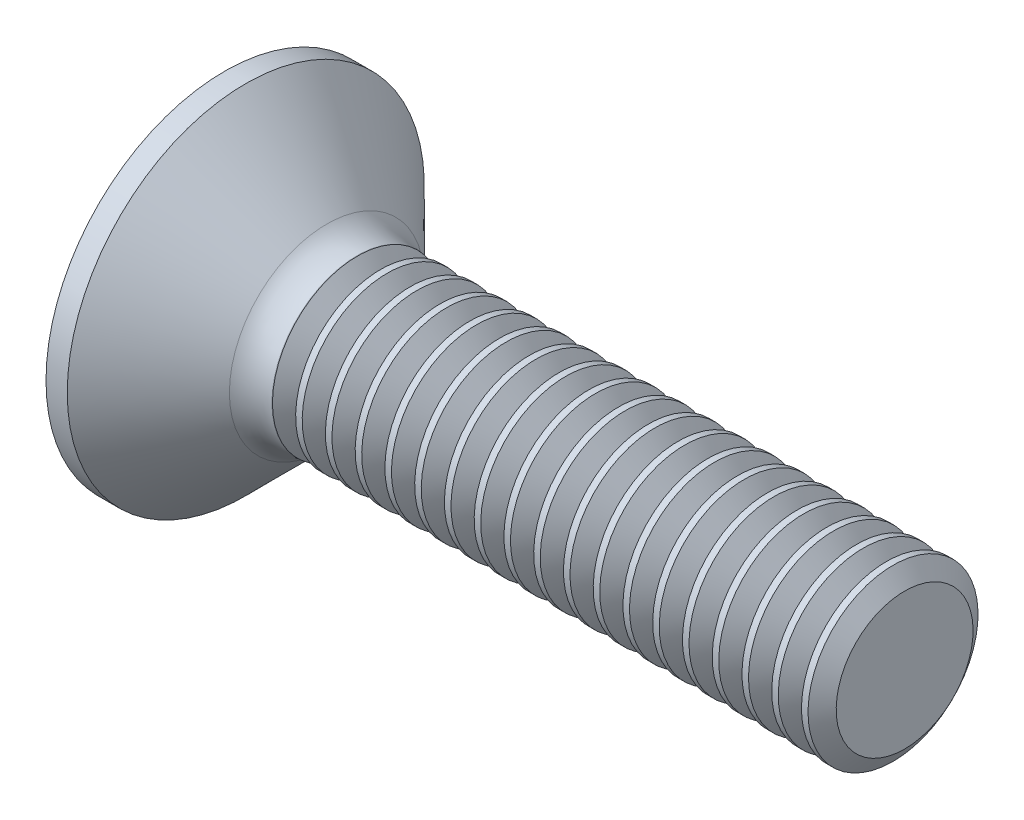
ISO-10303-21;
HEADER;
FILE_DESCRIPTION(('STEP AP214'),'2;1');
FILE_NAME('part.step','',(''),(''),'','','');
FILE_SCHEMA(('AUTOMOTIVE_DESIGN { 1 0 10303 214 1 1 1 1 }'));
ENDSEC;
DATA;
#1=APPLICATION_CONTEXT('core data for automotive mechanical design processes');
#2=APPLICATION_PROTOCOL_DEFINITION('international standard','automotive_design',2000,#1);
#3=PRODUCT_CONTEXT('',#1,'mechanical');
#4=PRODUCT('Part','Part','',(#3));
#5=PRODUCT_RELATED_PRODUCT_CATEGORY('part','',(#4));
#6=PRODUCT_DEFINITION_FORMATION('','',#4);
#7=PRODUCT_DEFINITION_CONTEXT('part definition',#1,'design');
#8=PRODUCT_DEFINITION('design','',#6,#7);
#9=PRODUCT_DEFINITION_SHAPE('','',#8);
#10=(LENGTH_UNIT() NAMED_UNIT(*) SI_UNIT(.MILLI.,.METRE.));
#11=(NAMED_UNIT(*) PLANE_ANGLE_UNIT() SI_UNIT($,.RADIAN.));
#12=(NAMED_UNIT(*) SI_UNIT($,.STERADIAN.) SOLID_ANGLE_UNIT());
#13=UNCERTAINTY_MEASURE_WITH_UNIT(LENGTH_MEASURE(1.E-05),#10,'distance_accuracy_value','');
#14=(GEOMETRIC_REPRESENTATION_CONTEXT(3) GLOBAL_UNCERTAINTY_ASSIGNED_CONTEXT((#13)) GLOBAL_UNIT_ASSIGNED_CONTEXT((#10,
#11,#12)) REPRESENTATION_CONTEXT('',''));
#15=CARTESIAN_POINT('',(0.,0.,0.));
#16=DIRECTION('',(0.,0.,1.));
#17=DIRECTION('',(1.,0.,0.));
#18=AXIS2_PLACEMENT_3D('',#15,#16,#17);
#19=CARTESIAN_POINT('',(9.32000000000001,0.,0.));
#20=DIRECTION('',(-1.,0.,0.));
#21=DIRECTION('',(0.,-1.,0.));
#22=AXIS2_PLACEMENT_3D('',#19,#20,#21);
#23=SPHERICAL_SURFACE('',#22,9.32000000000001);
#24=CARTESIAN_POINT('',(1.,0.,0.));
#25=DIRECTION('',(-1.,0.,0.));
#26=DIRECTION('',(0.,0.,1.));
#27=AXIS2_PLACEMENT_3D('',#24,#25,#26);
#28=CIRCLE('',#27,4.2);
#29=CARTESIAN_POINT('',(1.,0.,4.2));
#30=VERTEX_POINT('',#29);
#31=EDGE_CURVE('E498',#30,#30,#28,.T.);
#32=ORIENTED_EDGE('',*,*,#31,.T.);
#33=EDGE_LOOP('',(#32));
#34=FACE_BOUND('',#33,.T.);
#35=CARTESIAN_POINT('',(9.32000000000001,0.515,0.));
#36=DIRECTION('',(0.,-1.,0.));
#37=DIRECTION('',(0.,0.,-1.));
#38=AXIS2_PLACEMENT_3D('',#35,#36,#37);
#39=CIRCLE('',#38,9.3057603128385);
#40=CARTESIAN_POINT('',(0.314127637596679,0.515000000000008,-2.34338174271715));
#41=VERTEX_POINT('',#40);
#42=CARTESIAN_POINT('',(0.0608783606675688,0.515000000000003,-0.930506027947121));
#43=VERTEX_POINT('',#42);
#44=EDGE_CURVE('E471',#41,#43,#39,.F.);
#45=ORIENTED_EDGE('',*,*,#44,.T.);
#46=CARTESIAN_POINT('',(0.0608783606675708,0.,0.));
#47=DIRECTION('',(1.,0.,0.));
#48=DIRECTION('',(0.,0.,-1.));
#49=AXIS2_PLACEMENT_3D('',#46,#47,#48);
#50=CIRCLE('',#49,1.06351608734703);
#51=CARTESIAN_POINT('',(0.0608783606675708,0.930506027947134,-0.515));
#52=VERTEX_POINT('',#51);
#53=EDGE_CURVE('E373',#43,#52,#50,.T.);
#54=ORIENTED_EDGE('',*,*,#53,.T.);
#55=CARTESIAN_POINT('',(9.32000000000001,0.,-0.515));
#56=DIRECTION('',(0.,0.,1.));
#57=DIRECTION('',(1.,0.,0.));
#58=AXIS2_PLACEMENT_3D('',#55,#56,#57);
#59=CIRCLE('',#58,9.3057603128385);
#60=CARTESIAN_POINT('',(0.314127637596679,2.34338174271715,-0.515));
#61=VERTEX_POINT('',#60);
#62=EDGE_CURVE('E512',#52,#61,#59,.F.);
#63=ORIENTED_EDGE('',*,*,#62,.T.);
#64=CARTESIAN_POINT('',(8.46275247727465,-1.7193725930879,0.));
#65=DIRECTION('',(0.446197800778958,0.89493436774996,0.));
#66=DIRECTION('',(-0.89493436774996,0.446197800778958,0.));
#67=AXIS2_PLACEMENT_3D('',#64,#65,#66);
#68=CIRCLE('',#67,9.11982919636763);
#69=CARTESIAN_POINT('',(0.314127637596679,2.34338174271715,0.514999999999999));
#70=VERTEX_POINT('',#69);
#71=EDGE_CURVE('E516',#70,#61,#68,.F.);
#72=ORIENTED_EDGE('',*,*,#71,.F.);
#73=CARTESIAN_POINT('',(9.32000000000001,0.,0.515));
#74=DIRECTION('',(0.,0.,-1.));
#75=DIRECTION('',(0.,1.,0.));
#76=AXIS2_PLACEMENT_3D('',#73,#74,#75);
#77=CIRCLE('',#76,9.3057603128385);
#78=CARTESIAN_POINT('',(0.0608783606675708,0.930506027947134,0.515));
#79=VERTEX_POINT('',#78);
#80=EDGE_CURVE('E509',#70,#79,#77,.F.);
#81=ORIENTED_EDGE('',*,*,#80,.T.);
#82=CARTESIAN_POINT('',(0.0608783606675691,0.514999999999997,0.930506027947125));
#83=VERTEX_POINT('',#82);
#84=EDGE_CURVE('E408',#79,#83,#50,.T.);
#85=ORIENTED_EDGE('',*,*,#84,.T.);
#86=CARTESIAN_POINT('',(0.314127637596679,0.514999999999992,2.34338174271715));
#87=VERTEX_POINT('',#86);
#88=EDGE_CURVE('E469',#83,#87,#39,.F.);
#89=ORIENTED_EDGE('',*,*,#88,.T.);
#90=CARTESIAN_POINT('',(8.46275247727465,0.,-1.7193725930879));
#91=DIRECTION('',(0.446197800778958,0.,0.89493436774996));
#92=DIRECTION('',(0.89493436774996,0.,-0.446197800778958));
#93=AXIS2_PLACEMENT_3D('',#90,#91,#92);
#94=CIRCLE('',#93,9.11982919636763);
#95=CARTESIAN_POINT('',(0.314127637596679,-0.515000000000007,2.34338174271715));
#96=VERTEX_POINT('',#95);
#97=EDGE_CURVE('E43',#96,#87,#94,.F.);
#98=ORIENTED_EDGE('',*,*,#97,.F.);
#99=CARTESIAN_POINT('',(9.32000000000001,-0.515,0.));
#100=DIRECTION('',(0.,1.,0.));
#101=DIRECTION('',(0.,0.,1.));
#102=AXIS2_PLACEMENT_3D('',#99,#100,#101);
#103=CIRCLE('',#102,9.3057603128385);
#104=CARTESIAN_POINT('',(0.0608783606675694,-0.515000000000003,0.930506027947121));
#105=VERTEX_POINT('',#104);
#106=EDGE_CURVE('E445',#96,#105,#103,.F.);
#107=ORIENTED_EDGE('',*,*,#106,.T.);
#108=CARTESIAN_POINT('',(0.0608783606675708,-0.930506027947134,0.514999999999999));
#109=VERTEX_POINT('',#108);
#110=EDGE_CURVE('E372',#105,#109,#50,.T.);
#111=ORIENTED_EDGE('',*,*,#110,.T.);
#112=CARTESIAN_POINT('',(0.314127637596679,-2.34338174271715,0.514999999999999));
#113=VERTEX_POINT('',#112);
#114=EDGE_CURVE('E508',#109,#113,#77,.F.);
#115=ORIENTED_EDGE('',*,*,#114,.T.);
#116=CARTESIAN_POINT('',(8.46275247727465,1.7193725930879,0.));
#117=DIRECTION('',(0.446197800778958,-0.89493436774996,0.));
#118=DIRECTION('',(0.89493436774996,0.446197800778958,0.));
#119=AXIS2_PLACEMENT_3D('',#116,#117,#118);
#120=CIRCLE('',#119,9.11982919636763);
#121=CARTESIAN_POINT('',(0.314127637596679,-2.34338174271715,-0.515));
#122=VERTEX_POINT('',#121);
#123=EDGE_CURVE('E506',#122,#113,#120,.F.);
#124=ORIENTED_EDGE('',*,*,#123,.F.);
#125=CARTESIAN_POINT('',(0.0608783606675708,-0.930506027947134,-0.515));
#126=VERTEX_POINT('',#125);
#127=EDGE_CURVE('E513',#122,#126,#59,.F.);
#128=ORIENTED_EDGE('',*,*,#127,.T.);
#129=CARTESIAN_POINT('',(0.0608783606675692,-0.514999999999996,-0.930506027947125));
#130=VERTEX_POINT('',#129);
#131=EDGE_CURVE('E367',#126,#130,#50,.T.);
#132=ORIENTED_EDGE('',*,*,#131,.T.);
#133=CARTESIAN_POINT('',(0.314127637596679,-0.514999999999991,-2.34338174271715));
#134=VERTEX_POINT('',#133);
#135=EDGE_CURVE('E468',#130,#134,#103,.F.);
#136=ORIENTED_EDGE('',*,*,#135,.T.);
#137=CARTESIAN_POINT('',(8.46275247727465,0.,1.7193725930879));
#138=DIRECTION('',(0.446197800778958,0.,-0.89493436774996));
#139=DIRECTION('',(-0.89493436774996,0.,-0.446197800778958));
#140=AXIS2_PLACEMENT_3D('',#137,#138,#139);
#141=CIRCLE('',#140,9.11982919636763);
#142=EDGE_CURVE('E519',#41,#134,#141,.F.);
#143=ORIENTED_EDGE('',*,*,#142,.F.);
#144=EDGE_LOOP('',(#45,#54,#63,#72,#81,#85,#89,#98,#107,#111,#115,#124,#128,#132,#136,#143));
#145=FACE_BOUND('',#144,.T.);
#146=ADVANCED_FACE('F30',(#34,#145),#23,.T.);
#147=CARTESIAN_POINT('',(3.1,0.95439706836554,-0.515));
#148=DIRECTION('',(0.,0.,1.));
#149=DIRECTION('',(1.,0.,0.));
#150=AXIS2_PLACEMENT_3D('',#147,#148,#149);
#151=PLANE('',#150);
#152=ORIENTED_EDGE('',*,*,#62,.F.);
#153=CARTESIAN_POINT('',(-1.51350935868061,1.05457609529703,-0.515));
#154=CARTESIAN_POINT('',(-1.19095756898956,1.02946929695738,-0.515));
#155=CARTESIAN_POINT('',(-0.868418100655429,1.00420218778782,-0.515));
#156=CARTESIAN_POINT('',(-0.223370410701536,0.953235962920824,-0.515));
#157=CARTESIAN_POINT('',(0.099137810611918,0.927536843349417,-0.515));
#158=CARTESIAN_POINT('',(0.744110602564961,0.875595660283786,-0.515));
#159=CARTESIAN_POINT('',(1.06657517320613,0.849353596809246,-0.515));
#160=CARTESIAN_POINT('',(1.71144366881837,0.796155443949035,-0.515));
#161=CARTESIAN_POINT('',(2.03384759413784,0.769199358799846,-0.515));
#162=CARTESIAN_POINT('',(2.59585161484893,0.721356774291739,-0.515));
#163=CARTESIAN_POINT('',(2.83547018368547,0.700687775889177,-0.515));
#164=CARTESIAN_POINT('',(3.31464494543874,0.658646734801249,-0.515));
#165=CARTESIAN_POINT('',(3.55420113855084,0.637274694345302,-0.515));
#166=CARTESIAN_POINT('',(4.0332358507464,0.593604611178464,-0.515));
#167=CARTESIAN_POINT('',(4.27271436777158,0.571306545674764,-0.515));
#168=CARTESIAN_POINT('',(4.75154290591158,0.525345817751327,-0.515));
#169=CARTESIAN_POINT('',(4.99089292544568,0.501683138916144,-0.515));
#170=CARTESIAN_POINT('',(5.23015335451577,0.477118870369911,-0.515));
#171=B_SPLINE_CURVE_WITH_KNOTS('',3,(#153,#154,#155,#156,#157,#158,#159,#160,#161,#162,#163,
#164,#165,#166,#167,#168,#169,#170),.UNSPECIFIED.,.F.,.F.,(4,2,2,2,2,2,2,2,4),(0.,
0.970582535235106,1.94117377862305,2.91176498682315,3.88235043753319,4.60387465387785,
5.32539658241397,6.04693628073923,6.76848466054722),.UNSPECIFIED.);
#172=CARTESIAN_POINT('',(3.1,0.677477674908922,-0.514999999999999));
#173=VERTEX_POINT('',#172);
#174=EDGE_CURVE('E396',#52,#173,#171,.T.);
#175=ORIENTED_EDGE('',*,*,#174,.T.);
#176=DIRECTION('',(0.,1.,0.));
#177=VECTOR('',#176,1.);
#178=CARTESIAN_POINT('',(3.1,-0.954397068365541,-0.515));
#179=LINE('',#178,#177);
#180=CARTESIAN_POINT('',(3.1,0.954397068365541,-0.515));
#181=VERTEX_POINT('',#180);
#182=EDGE_CURVE('E495',#173,#181,#179,.T.);
#183=ORIENTED_EDGE('',*,*,#182,.T.);
#184=DIRECTION('',(0.89493436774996,-0.446197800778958,0.));
#185=VECTOR('',#184,1.);
#186=CARTESIAN_POINT('',(0.,2.5,-0.515));
#187=LINE('',#186,#185);
#188=EDGE_CURVE('E472',#61,#181,#187,.T.);
#189=ORIENTED_EDGE('',*,*,#188,.F.);
#190=EDGE_LOOP('',(#152,#175,#183,#189));
#191=FACE_BOUND('',#190,.T.);
#192=ADVANCED_FACE('F169',(#191),#151,.T.);
#193=CARTESIAN_POINT('',(3.1,-0.954397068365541,-0.515));
#194=VERTEX_POINT('',#193);
#195=CARTESIAN_POINT('',(3.1,-0.677477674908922,-0.514999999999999));
#196=VERTEX_POINT('',#195);
#197=EDGE_CURVE('E492',#194,#196,#179,.T.);
#198=ORIENTED_EDGE('',*,*,#197,.T.);
#199=CARTESIAN_POINT('',(-1.51350935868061,-1.05457609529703,-0.515));
#200=CARTESIAN_POINT('',(-1.19095756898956,-1.02946929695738,-0.515));
#201=CARTESIAN_POINT('',(-0.868418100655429,-1.00420218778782,-0.515));
#202=CARTESIAN_POINT('',(-0.223370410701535,-0.953235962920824,-0.515));
#203=CARTESIAN_POINT('',(0.0991378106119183,-0.927536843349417,-0.515));
#204=CARTESIAN_POINT('',(0.744110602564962,-0.875595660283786,-0.515));
#205=CARTESIAN_POINT('',(1.06657517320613,-0.849353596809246,-0.515));
#206=CARTESIAN_POINT('',(1.71144366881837,-0.796155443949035,-0.515));
#207=CARTESIAN_POINT('',(2.03384759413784,-0.769199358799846,-0.515));
#208=CARTESIAN_POINT('',(2.59585161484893,-0.721356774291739,-0.515));
#209=CARTESIAN_POINT('',(2.83547018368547,-0.700687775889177,-0.515));
#210=CARTESIAN_POINT('',(3.31464494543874,-0.658646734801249,-0.515));
#211=CARTESIAN_POINT('',(3.55420113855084,-0.637274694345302,-0.515));
#212=CARTESIAN_POINT('',(4.0332358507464,-0.593604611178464,-0.515));
#213=CARTESIAN_POINT('',(4.27271436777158,-0.571306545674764,-0.515));
#214=CARTESIAN_POINT('',(4.75154290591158,-0.525345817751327,-0.515));
#215=CARTESIAN_POINT('',(4.99089292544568,-0.501683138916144,-0.515));
#216=CARTESIAN_POINT('',(5.23015335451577,-0.477118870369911,-0.515));
#217=B_SPLINE_CURVE_WITH_KNOTS('',3,(#199,#200,#201,#202,#203,#204,#205,#206,#207,#208,#209,
#210,#211,#212,#213,#214,#215,#216),.UNSPECIFIED.,.F.,.F.,(4,2,2,2,2,2,2,2,4),(0.,
0.970582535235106,1.94117377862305,2.91176498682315,3.88235043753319,4.60387465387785,
5.32539658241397,6.04693628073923,6.76848466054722),.UNSPECIFIED.);
#218=EDGE_CURVE('E371',#196,#126,#217,.F.);
#219=ORIENTED_EDGE('',*,*,#218,.T.);
#220=ORIENTED_EDGE('',*,*,#127,.F.);
#221=DIRECTION('',(0.89493436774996,0.446197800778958,0.));
#222=VECTOR('',#221,1.);
#223=CARTESIAN_POINT('',(0.,-2.5,-0.515));
#224=LINE('',#223,#222);
#225=EDGE_CURVE('E58',#122,#194,#224,.T.);
#226=ORIENTED_EDGE('',*,*,#225,.T.);
#227=EDGE_LOOP('',(#198,#219,#220,#226));
#228=FACE_BOUND('',#227,.T.);
#229=ADVANCED_FACE('F175',(#228),#151,.T.);
#230=CARTESIAN_POINT('',(3.1,-0.954397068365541,0.515));
#231=DIRECTION('',(0.,0.,-1.));
#232=DIRECTION('',(0.,1.,0.));
#233=AXIS2_PLACEMENT_3D('',#230,#231,#232);
#234=PLANE('',#233);
#235=DIRECTION('',(0.,-1.,0.));
#236=VECTOR('',#235,1.);
#237=CARTESIAN_POINT('',(3.1,0.954397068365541,0.515));
#238=LINE('',#237,#236);
#239=CARTESIAN_POINT('',(3.1,0.954397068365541,0.515));
#240=VERTEX_POINT('',#239);
#241=CARTESIAN_POINT('',(3.1,0.677477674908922,0.514999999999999));
#242=VERTEX_POINT('',#241);
#243=EDGE_CURVE('E485',#240,#242,#238,.T.);
#244=ORIENTED_EDGE('',*,*,#243,.T.);
#245=CARTESIAN_POINT('',(-1.51350936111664,1.0545760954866,0.515));
#246=CARTESIAN_POINT('',(-1.19095757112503,1.02946929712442,0.515));
#247=CARTESIAN_POINT('',(-0.868418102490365,1.00420218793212,0.515));
#248=CARTESIAN_POINT('',(-0.223370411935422,0.953235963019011,0.515));
#249=CARTESIAN_POINT('',(0.0991378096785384,0.927536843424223,0.515));
#250=CARTESIAN_POINT('',(0.744110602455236,0.875595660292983,0.515));
#251=CARTESIAN_POINT('',(1.06657517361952,0.849353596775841,0.515));
#252=CARTESIAN_POINT('',(1.71144367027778,0.796155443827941,0.515));
#253=CARTESIAN_POINT('',(2.03384759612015,0.769199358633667,0.515));
#254=CARTESIAN_POINT('',(2.59585161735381,0.721356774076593,0.515));
#255=CARTESIAN_POINT('',(2.83547018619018,0.70068777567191,0.515));
#256=CARTESIAN_POINT('',(3.31464494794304,0.658646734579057,0.515));
#257=CARTESIAN_POINT('',(3.5542011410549,0.637274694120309,0.515));
#258=CARTESIAN_POINT('',(4.03323585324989,0.593604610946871,0.515));
#259=CARTESIAN_POINT('',(4.27271437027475,0.571306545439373,0.515));
#260=CARTESIAN_POINT('',(4.7515429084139,0.525345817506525,0.515));
#261=CARTESIAN_POINT('',(4.99089292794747,0.501683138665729,0.515));
#262=CARTESIAN_POINT('',(5.23015335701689,0.477118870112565,0.515));
#263=B_SPLINE_CURVE_WITH_KNOTS('',3,(#245,#246,#247,#248,#249,#250,#251,#252,#253,#254,#255,
#256,#257,#258,#259,#260,#261,#262),.UNSPECIFIED.,.F.,.F.,(4,2,2,2,2,2,2,2,4),(0.,
0.970582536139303,1.94117378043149,2.91176499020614,3.88235044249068,4.60387465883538,
5.32539658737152,6.04693628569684,6.76848466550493),.UNSPECIFIED.);
#264=EDGE_CURVE('E409',#242,#79,#263,.F.);
#265=ORIENTED_EDGE('',*,*,#264,.T.);
#266=ORIENTED_EDGE('',*,*,#80,.F.);
#267=DIRECTION('',(0.89493436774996,-0.446197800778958,0.));
#268=VECTOR('',#267,1.);
#269=CARTESIAN_POINT('',(0.,2.5,0.515));
#270=LINE('',#269,#268);
#271=EDGE_CURVE('E476',#70,#240,#270,.T.);
#272=ORIENTED_EDGE('',*,*,#271,.T.);
#273=EDGE_LOOP('',(#244,#265,#266,#272));
#274=FACE_BOUND('',#273,.T.);
#275=ADVANCED_FACE('F392',(#274),#234,.T.);
#276=ORIENTED_EDGE('',*,*,#114,.F.);
#277=CARTESIAN_POINT('',(-1.51350936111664,-1.0545760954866,0.514999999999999));
#278=CARTESIAN_POINT('',(-1.19095757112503,-1.02946929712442,0.514999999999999));
#279=CARTESIAN_POINT('',(-0.868418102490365,-1.00420218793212,0.514999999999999));
#280=CARTESIAN_POINT('',(-0.223370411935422,-0.953235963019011,0.514999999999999));
#281=CARTESIAN_POINT('',(0.0991378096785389,-0.927536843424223,0.514999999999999));
#282=CARTESIAN_POINT('',(0.744110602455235,-0.875595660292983,0.514999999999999));
#283=CARTESIAN_POINT('',(1.06657517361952,-0.849353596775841,0.514999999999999));
#284=CARTESIAN_POINT('',(1.71144367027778,-0.796155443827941,0.514999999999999));
#285=CARTESIAN_POINT('',(2.03384759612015,-0.769199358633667,0.515));
#286=CARTESIAN_POINT('',(2.59585161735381,-0.721356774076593,0.515));
#287=CARTESIAN_POINT('',(2.83547018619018,-0.70068777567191,0.515));
#288=CARTESIAN_POINT('',(3.31464494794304,-0.658646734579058,0.515));
#289=CARTESIAN_POINT('',(3.5542011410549,-0.637274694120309,0.515));
#290=CARTESIAN_POINT('',(4.03323585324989,-0.593604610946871,0.515));
#291=CARTESIAN_POINT('',(4.27271437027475,-0.571306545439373,0.515));
#292=CARTESIAN_POINT('',(4.7515429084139,-0.525345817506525,0.515));
#293=CARTESIAN_POINT('',(4.99089292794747,-0.501683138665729,0.515));
#294=CARTESIAN_POINT('',(5.23015335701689,-0.477118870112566,0.515));
#295=B_SPLINE_CURVE_WITH_KNOTS('',3,(#277,#278,#279,#280,#281,#282,#283,#284,#285,#286,#287,
#288,#289,#290,#291,#292,#293,#294),.UNSPECIFIED.,.F.,.F.,(4,2,2,2,2,2,2,2,4),(0.,
0.970582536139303,1.94117378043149,2.91176499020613,3.88235044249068,4.60387465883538,
5.32539658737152,6.04693628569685,6.76848466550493),.UNSPECIFIED.);
#296=CARTESIAN_POINT('',(3.1,-0.677477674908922,0.514999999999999));
#297=VERTEX_POINT('',#296);
#298=EDGE_CURVE('E435',#109,#297,#295,.T.);
#299=ORIENTED_EDGE('',*,*,#298,.T.);
#300=CARTESIAN_POINT('',(3.1,-0.954397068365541,0.515));
#301=VERTEX_POINT('',#300);
#302=EDGE_CURVE('E488',#297,#301,#238,.T.);
#303=ORIENTED_EDGE('',*,*,#302,.T.);
#304=DIRECTION('',(0.89493436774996,0.446197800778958,0.));
#305=VECTOR('',#304,1.);
#306=CARTESIAN_POINT('',(0.,-2.5,0.514999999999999));
#307=LINE('',#306,#305);
#308=EDGE_CURVE('E479',#113,#301,#307,.T.);
#309=ORIENTED_EDGE('',*,*,#308,.F.);
#310=EDGE_LOOP('',(#276,#299,#303,#309));
#311=FACE_BOUND('',#310,.T.);
#312=ADVANCED_FACE('F540',(#311),#234,.T.);
#313=CARTESIAN_POINT('',(3.1,-0.954397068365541,-0.515));
#314=DIRECTION('',(1.,0.,0.));
#315=DIRECTION('',(0.,0.,-1.));
#316=AXIS2_PLACEMENT_3D('',#313,#314,#315);
#317=PLANE('',#316);
#318=CARTESIAN_POINT('',(3.1,0.,0.));
#319=DIRECTION('',(-1.,0.,0.));
#320=DIRECTION('',(0.,0.,1.));
#321=AXIS2_PLACEMENT_3D('',#318,#319,#320);
#322=CIRCLE('',#321,0.850999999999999);
#323=EDGE_CURVE('E548',#196,#297,#322,.T.);
#324=ORIENTED_EDGE('',*,*,#323,.F.);
#325=ORIENTED_EDGE('',*,*,#197,.F.);
#326=DIRECTION('',(0.,0.,1.));
#327=VECTOR('',#326,1.);
#328=CARTESIAN_POINT('',(3.1,-0.954397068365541,-0.515));
#329=LINE('',#328,#327);
#330=EDGE_CURVE('E482',#194,#301,#329,.T.);
#331=ORIENTED_EDGE('',*,*,#330,.T.);
#332=ORIENTED_EDGE('',*,*,#302,.F.);
#333=EDGE_LOOP('',(#324,#325,#331,#332));
#334=FACE_BOUND('',#333,.T.);
#335=ADVANCED_FACE('F546',(#334),#317,.F.);
#336=CARTESIAN_POINT('',(3.1,-0.515000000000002,0.677477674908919));
#337=VERTEX_POINT('',#336);
#338=CARTESIAN_POINT('',(3.1,0.514999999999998,0.677477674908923));
#339=VERTEX_POINT('',#338);
#340=EDGE_CURVE('E364',#337,#339,#322,.T.);
#341=ORIENTED_EDGE('',*,*,#340,.F.);
#342=DIRECTION('',(0.,0.,-1.));
#343=VECTOR('',#342,1.);
#344=CARTESIAN_POINT('',(3.1,-0.515000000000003,0.954397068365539));
#345=LINE('',#344,#343);
#346=CARTESIAN_POINT('',(3.1,-0.515000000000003,0.954397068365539));
#347=VERTEX_POINT('',#346);
#348=EDGE_CURVE('E456',#347,#337,#345,.T.);
#349=ORIENTED_EDGE('',*,*,#348,.F.);
#350=DIRECTION('',(0.,1.,0.));
#351=VECTOR('',#350,1.);
#352=CARTESIAN_POINT('',(3.1,-0.515000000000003,0.954397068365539));
#353=LINE('',#352,#351);
#354=CARTESIAN_POINT('',(3.1,0.514999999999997,0.954397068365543));
#355=VERTEX_POINT('',#354);
#356=EDGE_CURVE('E460',#347,#355,#353,.T.);
#357=ORIENTED_EDGE('',*,*,#356,.T.);
#358=DIRECTION('',(0.,0.,1.));
#359=VECTOR('',#358,1.);
#360=CARTESIAN_POINT('',(3.1,0.515000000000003,-0.954397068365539));
#361=LINE('',#360,#359);
#362=EDGE_CURVE('E441',#339,#355,#361,.T.);
#363=ORIENTED_EDGE('',*,*,#362,.F.);
#364=EDGE_LOOP('',(#341,#349,#357,#363));
#365=FACE_BOUND('',#364,.T.);
#366=ADVANCED_FACE('F531',(#365),#317,.F.);
#367=EDGE_CURVE('E368',#242,#173,#322,.T.);
#368=ORIENTED_EDGE('',*,*,#367,.F.);
#369=ORIENTED_EDGE('',*,*,#243,.F.);
#370=DIRECTION('',(0.,0.,-1.));
#371=VECTOR('',#370,1.);
#372=CARTESIAN_POINT('',(3.1,0.954397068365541,0.515));
#373=LINE('',#372,#371);
#374=EDGE_CURVE('E489',#240,#181,#373,.T.);
#375=ORIENTED_EDGE('',*,*,#374,.T.);
#376=ORIENTED_EDGE('',*,*,#182,.F.);
#377=EDGE_LOOP('',(#368,#369,#375,#376));
#378=FACE_BOUND('',#377,.T.);
#379=ADVANCED_FACE('F573',(#378),#317,.F.);
#380=CARTESIAN_POINT('',(3.1,0.515000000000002,-0.677477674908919));
#381=VERTEX_POINT('',#380);
#382=CARTESIAN_POINT('',(3.1,-0.514999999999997,-0.677477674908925));
#383=VERTEX_POINT('',#382);
#384=EDGE_CURVE('E50',#381,#383,#322,.T.);
#385=ORIENTED_EDGE('',*,*,#384,.F.);
#386=CARTESIAN_POINT('',(3.1,0.515000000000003,-0.954397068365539));
#387=VERTEX_POINT('',#386);
#388=EDGE_CURVE('E463',#387,#381,#361,.T.);
#389=ORIENTED_EDGE('',*,*,#388,.F.);
#390=DIRECTION('',(0.,-1.,0.));
#391=VECTOR('',#390,1.);
#392=CARTESIAN_POINT('',(3.1,0.515000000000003,-0.954397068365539));
#393=LINE('',#392,#391);
#394=CARTESIAN_POINT('',(3.1,-0.514999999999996,-0.954397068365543));
#395=VERTEX_POINT('',#394);
#396=EDGE_CURVE('E453',#387,#395,#393,.T.);
#397=ORIENTED_EDGE('',*,*,#396,.T.);
#398=EDGE_CURVE('E459',#383,#395,#345,.T.);
#399=ORIENTED_EDGE('',*,*,#398,.F.);
#400=EDGE_LOOP('',(#385,#389,#397,#399));
#401=FACE_BOUND('',#400,.T.);
#402=ADVANCED_FACE('F424',(#401),#317,.F.);
#403=CARTESIAN_POINT('',(3.1,-0.514999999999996,-0.954397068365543));
#404=DIRECTION('',(0.,1.,0.));
#405=DIRECTION('',(0.,0.,1.));
#406=AXIS2_PLACEMENT_3D('',#403,#404,#405);
#407=PLANE('',#406);
#408=ORIENTED_EDGE('',*,*,#348,.T.);
#409=CARTESIAN_POINT('',(-1.51350935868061,-0.515000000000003,1.05457609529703));
#410=CARTESIAN_POINT('',(-1.19095756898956,-0.515000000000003,1.02946929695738));
#411=CARTESIAN_POINT('',(-0.86841810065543,-0.515000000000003,1.00420218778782));
#412=CARTESIAN_POINT('',(-0.223370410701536,-0.515000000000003,0.953235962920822));
#413=CARTESIAN_POINT('',(0.0991378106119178,-0.515000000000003,0.927536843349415));
#414=CARTESIAN_POINT('',(0.744110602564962,-0.515000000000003,0.875595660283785));
#415=CARTESIAN_POINT('',(1.06657517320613,-0.515000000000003,0.849353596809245));
#416=CARTESIAN_POINT('',(1.71144366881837,-0.515000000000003,0.796155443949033));
#417=CARTESIAN_POINT('',(2.03384759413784,-0.515000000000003,0.769199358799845));
#418=CARTESIAN_POINT('',(2.59585161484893,-0.515000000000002,0.721356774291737));
#419=CARTESIAN_POINT('',(2.83547018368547,-0.515000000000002,0.700687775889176));
#420=CARTESIAN_POINT('',(3.31464494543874,-0.515000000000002,0.658646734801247));
#421=CARTESIAN_POINT('',(3.55420113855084,-0.515000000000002,0.6372746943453));
#422=CARTESIAN_POINT('',(4.0332358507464,-0.515000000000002,0.593604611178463));
#423=CARTESIAN_POINT('',(4.27271436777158,-0.515000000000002,0.571306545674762));
#424=CARTESIAN_POINT('',(4.75154290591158,-0.515000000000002,0.525345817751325));
#425=CARTESIAN_POINT('',(4.99089292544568,-0.515000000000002,0.501683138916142));
#426=CARTESIAN_POINT('',(5.23015335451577,-0.515000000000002,0.477118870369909));
#427=B_SPLINE_CURVE_WITH_KNOTS('',3,(#409,#410,#411,#412,#413,#414,#415,#416,#417,#418,#419,
#420,#421,#422,#423,#424,#425,#426),.UNSPECIFIED.,.F.,.F.,(4,2,2,2,2,2,2,2,4),(0.,
0.970582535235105,1.94117377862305,2.91176498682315,3.88235043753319,4.60387465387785,
5.32539658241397,6.04693628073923,6.76848466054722),.UNSPECIFIED.);
#428=EDGE_CURVE('E429',#337,#105,#427,.F.);
#429=ORIENTED_EDGE('',*,*,#428,.T.);
#430=ORIENTED_EDGE('',*,*,#106,.F.);
#431=DIRECTION('',(0.89493436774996,0.,-0.446197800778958));
#432=VECTOR('',#431,1.);
#433=CARTESIAN_POINT('',(0.,-0.515000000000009,2.5));
#434=LINE('',#433,#432);
#435=EDGE_CURVE('E446',#96,#347,#434,.T.);
#436=ORIENTED_EDGE('',*,*,#435,.T.);
#437=EDGE_LOOP('',(#408,#429,#430,#436));
#438=FACE_BOUND('',#437,.T.);
#439=ADVANCED_FACE('F418',(#438),#407,.T.);
#440=CARTESIAN_POINT('',(3.1,0.514999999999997,0.954397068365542));
#441=DIRECTION('',(0.,-1.,0.));
#442=DIRECTION('',(1.,0.,0.));
#443=AXIS2_PLACEMENT_3D('',#440,#441,#442);
#444=PLANE('',#443);
#445=ORIENTED_EDGE('',*,*,#88,.F.);
#446=CARTESIAN_POINT('',(-1.51350936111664,0.514999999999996,1.0545760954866));
#447=CARTESIAN_POINT('',(-1.19095757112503,0.514999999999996,1.02946929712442));
#448=CARTESIAN_POINT('',(-0.868418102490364,0.514999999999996,1.00420218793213));
#449=CARTESIAN_POINT('',(-0.223370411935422,0.514999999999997,0.953235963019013));
#450=CARTESIAN_POINT('',(0.0991378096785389,0.514999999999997,0.927536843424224));
#451=CARTESIAN_POINT('',(0.744110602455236,0.514999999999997,0.875595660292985));
#452=CARTESIAN_POINT('',(1.06657517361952,0.514999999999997,0.849353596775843));
#453=CARTESIAN_POINT('',(1.71144367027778,0.514999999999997,0.796155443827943));
#454=CARTESIAN_POINT('',(2.03384759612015,0.514999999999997,0.769199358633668));
#455=CARTESIAN_POINT('',(2.59585161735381,0.514999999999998,0.721356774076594));
#456=CARTESIAN_POINT('',(2.83547018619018,0.514999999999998,0.700687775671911));
#457=CARTESIAN_POINT('',(3.31464494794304,0.514999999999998,0.658646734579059));
#458=CARTESIAN_POINT('',(3.5542011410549,0.514999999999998,0.63727469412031));
#459=CARTESIAN_POINT('',(4.03323585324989,0.514999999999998,0.593604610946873));
#460=CARTESIAN_POINT('',(4.27271437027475,0.514999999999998,0.571306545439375));
#461=CARTESIAN_POINT('',(4.7515429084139,0.514999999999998,0.525345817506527));
#462=CARTESIAN_POINT('',(4.99089292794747,0.514999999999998,0.501683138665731));
#463=CARTESIAN_POINT('',(5.23015335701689,0.514999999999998,0.477118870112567));
#464=B_SPLINE_CURVE_WITH_KNOTS('',3,(#446,#447,#448,#449,#450,#451,#452,#453,#454,#455,#456,
#457,#458,#459,#460,#461,#462,#463),.UNSPECIFIED.,.F.,.F.,(4,2,2,2,2,2,2,2,4),(0.,
0.970582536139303,1.94117378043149,2.91176499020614,3.88235044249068,4.60387465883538,
5.32539658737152,6.04693628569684,6.76848466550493),.UNSPECIFIED.);
#465=EDGE_CURVE('E402',#83,#339,#464,.T.);
#466=ORIENTED_EDGE('',*,*,#465,.T.);
#467=ORIENTED_EDGE('',*,*,#362,.T.);
#468=DIRECTION('',(0.89493436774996,0.,-0.446197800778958));
#469=VECTOR('',#468,1.);
#470=CARTESIAN_POINT('',(0.,0.514999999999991,2.5));
#471=LINE('',#470,#469);
#472=EDGE_CURVE('E442',#87,#355,#471,.T.);
#473=ORIENTED_EDGE('',*,*,#472,.F.);
#474=EDGE_LOOP('',(#445,#466,#467,#473));
#475=FACE_BOUND('',#474,.T.);
#476=ADVANCED_FACE('F414',(#475),#444,.T.);
#477=ORIENTED_EDGE('',*,*,#388,.T.);
#478=CARTESIAN_POINT('',(-1.51350936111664,0.515000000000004,-1.0545760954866));
#479=CARTESIAN_POINT('',(-1.19095757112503,0.515000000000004,-1.02946929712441));
#480=CARTESIAN_POINT('',(-0.868418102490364,0.515000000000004,-1.00420218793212));
#481=CARTESIAN_POINT('',(-0.223370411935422,0.515000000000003,-0.953235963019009));
#482=CARTESIAN_POINT('',(0.0991378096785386,0.515000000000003,-0.927536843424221));
#483=CARTESIAN_POINT('',(0.744110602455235,0.515000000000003,-0.875595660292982));
#484=CARTESIAN_POINT('',(1.06657517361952,0.515000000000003,-0.849353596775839));
#485=CARTESIAN_POINT('',(1.71144367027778,0.515000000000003,-0.796155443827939));
#486=CARTESIAN_POINT('',(2.03384759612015,0.515000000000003,-0.769199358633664));
#487=CARTESIAN_POINT('',(2.59585161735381,0.515000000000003,-0.721356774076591));
#488=CARTESIAN_POINT('',(2.83547018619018,0.515000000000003,-0.700687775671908));
#489=CARTESIAN_POINT('',(3.31464494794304,0.515000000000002,-0.658646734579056));
#490=CARTESIAN_POINT('',(3.5542011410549,0.515000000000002,-0.637274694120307));
#491=CARTESIAN_POINT('',(4.03323585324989,0.515000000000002,-0.593604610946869));
#492=CARTESIAN_POINT('',(4.27271437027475,0.515000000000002,-0.571306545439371));
#493=CARTESIAN_POINT('',(4.7515429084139,0.515000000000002,-0.525345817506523));
#494=CARTESIAN_POINT('',(4.99089292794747,0.515000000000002,-0.501683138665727));
#495=CARTESIAN_POINT('',(5.23015335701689,0.515000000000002,-0.477118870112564));
#496=B_SPLINE_CURVE_WITH_KNOTS('',3,(#478,#479,#480,#481,#482,#483,#484,#485,#486,#487,#488,
#489,#490,#491,#492,#493,#494,#495),.UNSPECIFIED.,.F.,.F.,(4,2,2,2,2,2,2,2,4),(0.,
0.970582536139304,1.94117378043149,2.91176499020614,3.88235044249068,4.60387465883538,
5.32539658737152,6.04693628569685,6.76848466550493),.UNSPECIFIED.);
#497=EDGE_CURVE('E379',#381,#43,#496,.F.);
#498=ORIENTED_EDGE('',*,*,#497,.T.);
#499=ORIENTED_EDGE('',*,*,#44,.F.);
#500=DIRECTION('',(0.89493436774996,0.,0.446197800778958));
#501=VECTOR('',#500,1.);
#502=CARTESIAN_POINT('',(0.,0.515000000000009,-2.5));
#503=LINE('',#502,#501);
#504=EDGE_CURVE('E448',#41,#387,#503,.T.);
#505=ORIENTED_EDGE('',*,*,#504,.T.);
#506=EDGE_LOOP('',(#477,#498,#499,#505));
#507=FACE_BOUND('',#506,.T.);
#508=ADVANCED_FACE('F417',(#507),#444,.T.);
#509=ORIENTED_EDGE('',*,*,#135,.F.);
#510=CARTESIAN_POINT('',(-1.51350935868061,-0.514999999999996,-1.05457609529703));
#511=CARTESIAN_POINT('',(-1.19095756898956,-0.514999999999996,-1.02946929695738));
#512=CARTESIAN_POINT('',(-0.86841810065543,-0.514999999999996,-1.00420218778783));
#513=CARTESIAN_POINT('',(-0.223370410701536,-0.514999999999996,-0.953235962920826));
#514=CARTESIAN_POINT('',(0.0991378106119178,-0.514999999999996,-0.927536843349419));
#515=CARTESIAN_POINT('',(0.744110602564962,-0.514999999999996,-0.875595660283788));
#516=CARTESIAN_POINT('',(1.06657517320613,-0.514999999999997,-0.849353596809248));
#517=CARTESIAN_POINT('',(1.71144366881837,-0.514999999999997,-0.796155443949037));
#518=CARTESIAN_POINT('',(2.03384759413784,-0.514999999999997,-0.769199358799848));
#519=CARTESIAN_POINT('',(2.59585161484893,-0.514999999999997,-0.721356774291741));
#520=CARTESIAN_POINT('',(2.83547018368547,-0.514999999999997,-0.700687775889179));
#521=CARTESIAN_POINT('',(3.31464494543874,-0.514999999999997,-0.658646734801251));
#522=CARTESIAN_POINT('',(3.55420113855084,-0.514999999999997,-0.637274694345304));
#523=CARTESIAN_POINT('',(4.0332358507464,-0.514999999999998,-0.593604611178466));
#524=CARTESIAN_POINT('',(4.27271436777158,-0.514999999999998,-0.571306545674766));
#525=CARTESIAN_POINT('',(4.75154290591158,-0.514999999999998,-0.525345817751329));
#526=CARTESIAN_POINT('',(4.99089292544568,-0.514999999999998,-0.501683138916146));
#527=CARTESIAN_POINT('',(5.23015335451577,-0.514999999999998,-0.477118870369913));
#528=B_SPLINE_CURVE_WITH_KNOTS('',3,(#510,#511,#512,#513,#514,#515,#516,#517,#518,#519,#520,
#521,#522,#523,#524,#525,#526,#527),.UNSPECIFIED.,.F.,.F.,(4,2,2,2,2,2,2,2,4),(0.,
0.970582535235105,1.94117377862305,2.91176498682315,3.88235043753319,4.60387465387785,
5.32539658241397,6.04693628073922,6.76848466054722),.UNSPECIFIED.);
#529=EDGE_CURVE('E11',#130,#383,#528,.T.);
#530=ORIENTED_EDGE('',*,*,#529,.T.);
#531=ORIENTED_EDGE('',*,*,#398,.T.);
#532=DIRECTION('',(0.89493436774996,0.,0.446197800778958));
#533=VECTOR('',#532,1.);
#534=CARTESIAN_POINT('',(0.,-0.51499999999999,-2.5));
#535=LINE('',#534,#533);
#536=EDGE_CURVE('E450',#134,#395,#535,.T.);
#537=ORIENTED_EDGE('',*,*,#536,.F.);
#538=EDGE_LOOP('',(#509,#530,#531,#537));
#539=FACE_BOUND('',#538,.T.);
#540=ADVANCED_FACE('F426',(#539),#407,.T.);
#541=CARTESIAN_POINT('',(-15.875,0.,0.));
#542=DIRECTION('',(-1.,0.,0.));
#543=DIRECTION('',(0.,0.,1.));
#544=AXIS2_PLACEMENT_3D('',#541,#542,#543);
#545=CYLINDRICAL_SURFACE('',#544,4.2);
#546=ORIENTED_EDGE('',*,*,#31,.F.);
#547=EDGE_LOOP('',(#546));
#548=FACE_BOUND('',#547,.T.);
#549=CARTESIAN_POINT('',(1.50000000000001,0.,0.));
#550=DIRECTION('',(-1.,0.,0.));
#551=DIRECTION('',(0.,0.,1.));
#552=AXIS2_PLACEMENT_3D('',#549,#550,#551);
#553=CIRCLE('',#552,4.2);
#554=CARTESIAN_POINT('',(1.50000000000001,0.,4.2));
#555=VERTEX_POINT('',#554);
#556=EDGE_CURVE('E475',#555,#555,#553,.T.);
#557=ORIENTED_EDGE('',*,*,#556,.T.);
#558=EDGE_LOOP('',(#557));
#559=FACE_BOUND('',#558,.T.);
#560=ADVANCED_FACE('F181',(#548,#559),#545,.T.);
#561=CARTESIAN_POINT('',(1.50000000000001,0.,0.));
#562=DIRECTION('',(-1.,0.,0.));
#563=DIRECTION('',(0.,0.,1.));
#564=AXIS2_PLACEMENT_3D('',#561,#562,#563);
#565=CONICAL_SURFACE('',#564,4.2,0.78539816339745);
#566=CARTESIAN_POINT('',(3.40710678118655,0.,0.));
#567=DIRECTION('',(1.,0.,0.));
#568=DIRECTION('',(0.,0.,-1.));
#569=AXIS2_PLACEMENT_3D('',#566,#567,#568);
#570=CIRCLE('',#569,2.29289321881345);
#571=CARTESIAN_POINT('',(3.40710678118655,0.,-2.29289321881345));
#572=VERTEX_POINT('',#571);
#573=EDGE_CURVE('E500',#572,#572,#570,.F.);
#574=ORIENTED_EDGE('',*,*,#573,.T.);
#575=EDGE_LOOP('',(#574));
#576=FACE_BOUND('',#575,.T.);
#577=ORIENTED_EDGE('',*,*,#556,.F.);
#578=EDGE_LOOP('',(#577));
#579=FACE_BOUND('',#578,.T.);
#580=ADVANCED_FACE('F611',(#576,#579),#565,.T.);
#581=CARTESIAN_POINT('',(-15.875,0.,0.));
#582=DIRECTION('',(-1.,0.,0.));
#583=DIRECTION('',(0.,0.,1.));
#584=AXIS2_PLACEMENT_3D('',#581,#582,#583);
#585=CYLINDRICAL_SURFACE('',#584,2.);
#586=CARTESIAN_POINT('',(4.12691906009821,0.,0.));
#587=DIRECTION('',(-1.,0.,0.));
#588=DIRECTION('',(0.,-1.,0.));
#589=AXIS2_PLACEMENT_3D('',#586,#587,#588);
#590=CIRCLE('',#589,2.);
#591=CARTESIAN_POINT('',(4.12691906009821,-2.,0.));
#592=VERTEX_POINT('',#591);
#593=EDGE_CURVE('E358',#592,#592,#590,.T.);
#594=ORIENTED_EDGE('',*,*,#593,.T.);
#595=EDGE_LOOP('',(#594));
#596=FACE_BOUND('',#595,.T.);
#597=CARTESIAN_POINT('',(4.1142135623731,0.,0.));
#598=DIRECTION('',(-1.,0.,0.));
#599=DIRECTION('',(0.,0.,1.));
#600=AXIS2_PLACEMENT_3D('',#597,#598,#599);
#601=CIRCLE('',#600,2.);
#602=CARTESIAN_POINT('',(4.1142135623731,0.,2.));
#603=VERTEX_POINT('',#602);
#604=EDGE_CURVE('E503',#603,#603,#601,.F.);
#605=ORIENTED_EDGE('',*,*,#604,.T.);
#606=EDGE_LOOP('',(#605));
#607=FACE_BOUND('',#606,.T.);
#608=ADVANCED_FACE('F606',(#596,#607),#585,.T.);
#609=CARTESIAN_POINT('',(4.1142135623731,0.,0.));
#610=DIRECTION('',(-1.,0.,0.));
#611=DIRECTION('',(0.,0.,1.));
#612=AXIS2_PLACEMENT_3D('',#609,#610,#611);
#613=TOROIDAL_SURFACE('',#612,3.,1.);
#614=ORIENTED_EDGE('',*,*,#604,.F.);
#615=EDGE_LOOP('',(#614));
#616=FACE_BOUND('',#615,.T.);
#617=ORIENTED_EDGE('',*,*,#573,.F.);
#618=EDGE_LOOP('',(#617));
#619=FACE_BOUND('',#618,.T.);
#620=ADVANCED_FACE('F32',(#616,#619),#613,.F.);
#621=CARTESIAN_POINT('',(0.,2.5,0.515));
#622=DIRECTION('',(0.446197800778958,0.89493436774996,0.));
#623=DIRECTION('',(-0.89493436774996,0.446197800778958,0.));
#624=AXIS2_PLACEMENT_3D('',#621,#622,#623);
#625=PLANE('',#624);
#626=ORIENTED_EDGE('',*,*,#71,.T.);
#627=ORIENTED_EDGE('',*,*,#188,.T.);
#628=ORIENTED_EDGE('',*,*,#374,.F.);
#629=ORIENTED_EDGE('',*,*,#271,.F.);
#630=EDGE_LOOP('',(#626,#627,#628,#629));
#631=FACE_BOUND('',#630,.T.);
#632=ADVANCED_FACE('F390',(#631),#625,.F.);
#633=CARTESIAN_POINT('',(3.1,-0.954397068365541,-0.515));
#634=DIRECTION('',(0.446197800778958,-0.89493436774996,0.));
#635=DIRECTION('',(0.89493436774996,0.446197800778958,0.));
#636=AXIS2_PLACEMENT_3D('',#633,#634,#635);
#637=PLANE('',#636);
#638=ORIENTED_EDGE('',*,*,#123,.T.);
#639=ORIENTED_EDGE('',*,*,#308,.T.);
#640=ORIENTED_EDGE('',*,*,#330,.F.);
#641=ORIENTED_EDGE('',*,*,#225,.F.);
#642=EDGE_LOOP('',(#638,#639,#640,#641));
#643=FACE_BOUND('',#642,.T.);
#644=ADVANCED_FACE('F542',(#643),#637,.F.);
#645=CARTESIAN_POINT('',(0.,-0.515000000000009,2.5));
#646=DIRECTION('',(0.446197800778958,0.,0.89493436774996));
#647=DIRECTION('',(-0.89493436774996,0.,0.446197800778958));
#648=AXIS2_PLACEMENT_3D('',#645,#646,#647);
#649=PLANE('',#648);
#650=ORIENTED_EDGE('',*,*,#97,.T.);
#651=ORIENTED_EDGE('',*,*,#472,.T.);
#652=ORIENTED_EDGE('',*,*,#356,.F.);
#653=ORIENTED_EDGE('',*,*,#435,.F.);
#654=EDGE_LOOP('',(#650,#651,#652,#653));
#655=FACE_BOUND('',#654,.T.);
#656=ADVANCED_FACE('F420',(#655),#649,.F.);
#657=CARTESIAN_POINT('',(3.1,0.515000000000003,-0.954397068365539));
#658=DIRECTION('',(0.446197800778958,0.,-0.89493436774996));
#659=DIRECTION('',(0.89493436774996,0.,0.446197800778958));
#660=AXIS2_PLACEMENT_3D('',#657,#658,#659);
#661=PLANE('',#660);
#662=ORIENTED_EDGE('',*,*,#142,.T.);
#663=ORIENTED_EDGE('',*,*,#536,.T.);
#664=ORIENTED_EDGE('',*,*,#396,.F.);
#665=ORIENTED_EDGE('',*,*,#504,.F.);
#666=EDGE_LOOP('',(#662,#663,#664,#665));
#667=FACE_BOUND('',#666,.T.);
#668=ADVANCED_FACE('F427',(#667),#661,.F.);
#669=CARTESIAN_POINT('',(3.1,0.,0.));
#670=DIRECTION('',(-1.,0.,0.));
#671=DIRECTION('',(0.,0.,1.));
#672=AXIS2_PLACEMENT_3D('',#669,#670,#671);
#673=CONICAL_SURFACE('',#672,0.850999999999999,0.0698131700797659);
#674=ORIENTED_EDGE('',*,*,#110,.F.);
#675=ORIENTED_EDGE('',*,*,#428,.F.);
#676=EDGE_CURVE('E582',#297,#337,#322,.T.);
#677=ORIENTED_EDGE('',*,*,#676,.F.);
#678=ORIENTED_EDGE('',*,*,#298,.F.);
#679=EDGE_LOOP('',(#674,#675,#677,#678));
#680=FACE_BOUND('',#679,.T.);
#681=ADVANCED_FACE('F166',(#680),#673,.F.);
#682=EDGE_CURVE('E365',#339,#242,#322,.T.);
#683=ORIENTED_EDGE('',*,*,#682,.F.);
#684=ORIENTED_EDGE('',*,*,#465,.F.);
#685=ORIENTED_EDGE('',*,*,#84,.F.);
#686=ORIENTED_EDGE('',*,*,#264,.F.);
#687=EDGE_LOOP('',(#683,#684,#685,#686));
#688=FACE_BOUND('',#687,.T.);
#689=ADVANCED_FACE('F580',(#688),#673,.F.);
#690=ORIENTED_EDGE('',*,*,#53,.F.);
#691=ORIENTED_EDGE('',*,*,#497,.F.);
#692=EDGE_CURVE('E584',#173,#381,#322,.T.);
#693=ORIENTED_EDGE('',*,*,#692,.F.);
#694=ORIENTED_EDGE('',*,*,#174,.F.);
#695=EDGE_LOOP('',(#690,#691,#693,#694));
#696=FACE_BOUND('',#695,.T.);
#697=ADVANCED_FACE('F164',(#696),#673,.F.);
#698=EDGE_CURVE('E583',#383,#196,#322,.T.);
#699=ORIENTED_EDGE('',*,*,#698,.F.);
#700=ORIENTED_EDGE('',*,*,#529,.F.);
#701=ORIENTED_EDGE('',*,*,#131,.F.);
#702=ORIENTED_EDGE('',*,*,#218,.F.);
#703=EDGE_LOOP('',(#699,#700,#701,#702));
#704=FACE_BOUND('',#703,.T.);
#705=ADVANCED_FACE('F155',(#704),#673,.F.);
#706=CARTESIAN_POINT('',(3.3765066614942,0.,0.));
#707=DIRECTION('',(-1.,0.,0.));
#708=DIRECTION('',(0.,0.,1.));
#709=AXIS2_PLACEMENT_3D('',#706,#707,#708);
#710=CONICAL_SURFACE('',#709,0.,1.25663706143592);
#711=ORIENTED_EDGE('',*,*,#682,.T.);
#712=ORIENTED_EDGE('',*,*,#367,.T.);
#713=ORIENTED_EDGE('',*,*,#692,.T.);
#714=ORIENTED_EDGE('',*,*,#384,.T.);
#715=ORIENTED_EDGE('',*,*,#698,.T.);
#716=ORIENTED_EDGE('',*,*,#323,.T.);
#717=ORIENTED_EDGE('',*,*,#676,.T.);
#718=ORIENTED_EDGE('',*,*,#340,.T.);
#719=EDGE_LOOP('',(#711,#712,#713,#714,#715,#716,#717,#718));
#720=FACE_BOUND('',#719,.T.);
#721=CARTESIAN_POINT('',(3.3765066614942,0.,0.));
#722=VERTEX_POINT('',#721);
#723=VERTEX_LOOP('',#722);
#724=FACE_BOUND('',#723,.T.);
#725=ADVANCED_FACE('F152',(#720,#724),#710,.F.);
#726=CARTESIAN_POINT('',(4.67308093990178,0.,0.));
#727=DIRECTION('',(1.,0.,0.));
#728=DIRECTION('',(0.,1.,0.));
#729=AXIS2_PLACEMENT_3D('',#726,#727,#728);
#730=CONICAL_SURFACE('',#729,2.,0.959931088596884);
#731=CARTESIAN_POINT('',(4.4,0.,0.));
#732=DIRECTION('',(-1.,0.,0.));
#733=DIRECTION('',(0.,-1.,0.));
#734=AXIS2_PLACEMENT_3D('',#731,#732,#733);
#735=CIRCLE('',#734,1.61);
#736=CARTESIAN_POINT('',(4.4,-1.61,0.));
#737=VERTEX_POINT('',#736);
#738=EDGE_CURVE('E355',#737,#737,#735,.T.);
#739=ORIENTED_EDGE('',*,*,#738,.F.);
#740=EDGE_LOOP('',(#739));
#741=FACE_BOUND('',#740,.T.);
#742=CARTESIAN_POINT('',(4.67308093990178,0.,0.));
#743=DIRECTION('',(-1.,0.,0.));
#744=DIRECTION('',(0.,-1.,0.));
#745=AXIS2_PLACEMENT_3D('',#742,#743,#744);
#746=CIRCLE('',#745,2.);
#747=CARTESIAN_POINT('',(4.67308093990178,-2.,0.));
#748=VERTEX_POINT('',#747);
#749=EDGE_CURVE('E361',#748,#748,#746,.T.);
#750=ORIENTED_EDGE('',*,*,#749,.T.);
#751=EDGE_LOOP('',(#750));
#752=FACE_BOUND('',#751,.T.);
#753=ADVANCED_FACE('F154',(#741,#752),#730,.T.);
#754=CARTESIAN_POINT('',(4.4,0.,0.));
#755=DIRECTION('',(-1.,0.,0.));
#756=DIRECTION('',(0.,-1.,0.));
#757=AXIS2_PLACEMENT_3D('',#754,#755,#756);
#758=CONICAL_SURFACE('',#757,1.61,0.959931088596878);
#759=ORIENTED_EDGE('',*,*,#593,.F.);
#760=EDGE_LOOP('',(#759));
#761=FACE_BOUND('',#760,.T.);
#762=ORIENTED_EDGE('',*,*,#738,.T.);
#763=EDGE_LOOP('',(#762));
#764=FACE_BOUND('',#763,.T.);
#765=ADVANCED_FACE('F161',(#761,#764),#758,.T.);
#766=CARTESIAN_POINT('',(4.82691906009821,0.,0.));
#767=DIRECTION('',(-1.,0.,0.));
#768=DIRECTION('',(0.,-1.,0.));
#769=AXIS2_PLACEMENT_3D('',#766,#767,#768);
#770=CIRCLE('',#769,2.);
#771=CARTESIAN_POINT('',(4.82691906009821,-2.,0.));
#772=VERTEX_POINT('',#771);
#773=EDGE_CURVE('E349',#772,#772,#770,.T.);
#774=ORIENTED_EDGE('',*,*,#773,.T.);
#775=EDGE_LOOP('',(#774));
#776=FACE_BOUND('',#775,.T.);
#777=ORIENTED_EDGE('',*,*,#749,.F.);
#778=EDGE_LOOP('',(#777));
#779=FACE_BOUND('',#778,.T.);
#780=ADVANCED_FACE('F614',(#776,#779),#585,.T.);
#781=CARTESIAN_POINT('',(5.37308093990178,0.,0.));
#782=DIRECTION('',(1.,0.,0.));
#783=DIRECTION('',(0.,1.,0.));
#784=AXIS2_PLACEMENT_3D('',#781,#782,#783);
#785=CONICAL_SURFACE('',#784,2.,0.959931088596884);
#786=CARTESIAN_POINT('',(5.1,0.,0.));
#787=DIRECTION('',(-1.,0.,0.));
#788=DIRECTION('',(0.,-1.,0.));
#789=AXIS2_PLACEMENT_3D('',#786,#787,#788);
#790=CIRCLE('',#789,1.61);
#791=CARTESIAN_POINT('',(5.1,-1.61,0.));
#792=VERTEX_POINT('',#791);
#793=EDGE_CURVE('E346',#792,#792,#790,.T.);
#794=ORIENTED_EDGE('',*,*,#793,.F.);
#795=EDGE_LOOP('',(#794));
#796=FACE_BOUND('',#795,.T.);
#797=CARTESIAN_POINT('',(5.37308093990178,0.,0.));
#798=DIRECTION('',(-1.,0.,0.));
#799=DIRECTION('',(0.,-1.,0.));
#800=AXIS2_PLACEMENT_3D('',#797,#798,#799);
#801=CIRCLE('',#800,2.);
#802=CARTESIAN_POINT('',(5.37308093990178,-2.,0.));
#803=VERTEX_POINT('',#802);
#804=EDGE_CURVE('E352',#803,#803,#801,.T.);
#805=ORIENTED_EDGE('',*,*,#804,.T.);
#806=EDGE_LOOP('',(#805));
#807=FACE_BOUND('',#806,.T.);
#808=ADVANCED_FACE('F1215',(#796,#807),#785,.T.);
#809=CARTESIAN_POINT('',(5.1,0.,0.));
#810=DIRECTION('',(-1.,0.,0.));
#811=DIRECTION('',(0.,-1.,0.));
#812=AXIS2_PLACEMENT_3D('',#809,#810,#811);
#813=CONICAL_SURFACE('',#812,1.61,0.959931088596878);
#814=ORIENTED_EDGE('',*,*,#773,.F.);
#815=EDGE_LOOP('',(#814));
#816=FACE_BOUND('',#815,.T.);
#817=ORIENTED_EDGE('',*,*,#793,.T.);
#818=EDGE_LOOP('',(#817));
#819=FACE_BOUND('',#818,.T.);
#820=ADVANCED_FACE('F1206',(#816,#819),#813,.T.);
#821=CARTESIAN_POINT('',(5.52691906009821,0.,0.));
#822=DIRECTION('',(-1.,0.,0.));
#823=DIRECTION('',(0.,-1.,0.));
#824=AXIS2_PLACEMENT_3D('',#821,#822,#823);
#825=CIRCLE('',#824,2.);
#826=CARTESIAN_POINT('',(5.52691906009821,-2.,0.));
#827=VERTEX_POINT('',#826);
#828=EDGE_CURVE('E340',#827,#827,#825,.T.);
#829=ORIENTED_EDGE('',*,*,#828,.T.);
#830=EDGE_LOOP('',(#829));
#831=FACE_BOUND('',#830,.T.);
#832=ORIENTED_EDGE('',*,*,#804,.F.);
#833=EDGE_LOOP('',(#832));
#834=FACE_BOUND('',#833,.T.);
#835=ADVANCED_FACE('F1179',(#831,#834),#585,.T.);
#836=CARTESIAN_POINT('',(6.07308093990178,0.,0.));
#837=DIRECTION('',(1.,0.,0.));
#838=DIRECTION('',(0.,1.,0.));
#839=AXIS2_PLACEMENT_3D('',#836,#837,#838);
#840=CONICAL_SURFACE('',#839,2.,0.959931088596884);
#841=CARTESIAN_POINT('',(5.8,0.,0.));
#842=DIRECTION('',(-1.,0.,0.));
#843=DIRECTION('',(0.,-1.,0.));
#844=AXIS2_PLACEMENT_3D('',#841,#842,#843);
#845=CIRCLE('',#844,1.61);
#846=CARTESIAN_POINT('',(5.8,-1.61,0.));
#847=VERTEX_POINT('',#846);
#848=EDGE_CURVE('E337',#847,#847,#845,.T.);
#849=ORIENTED_EDGE('',*,*,#848,.F.);
#850=EDGE_LOOP('',(#849));
#851=FACE_BOUND('',#850,.T.);
#852=CARTESIAN_POINT('',(6.07308093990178,0.,0.));
#853=DIRECTION('',(-1.,0.,0.));
#854=DIRECTION('',(0.,-1.,0.));
#855=AXIS2_PLACEMENT_3D('',#852,#853,#854);
#856=CIRCLE('',#855,2.);
#857=CARTESIAN_POINT('',(6.07308093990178,-2.,0.));
#858=VERTEX_POINT('',#857);
#859=EDGE_CURVE('E343',#858,#858,#856,.T.);
#860=ORIENTED_EDGE('',*,*,#859,.T.);
#861=EDGE_LOOP('',(#860));
#862=FACE_BOUND('',#861,.T.);
#863=ADVANCED_FACE('F1187',(#851,#862),#840,.T.);
#864=CARTESIAN_POINT('',(5.8,0.,0.));
#865=DIRECTION('',(-1.,0.,0.));
#866=DIRECTION('',(0.,-1.,0.));
#867=AXIS2_PLACEMENT_3D('',#864,#865,#866);
#868=CONICAL_SURFACE('',#867,1.61,0.959931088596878);
#869=ORIENTED_EDGE('',*,*,#828,.F.);
#870=EDGE_LOOP('',(#869));
#871=FACE_BOUND('',#870,.T.);
#872=ORIENTED_EDGE('',*,*,#848,.T.);
#873=EDGE_LOOP('',(#872));
#874=FACE_BOUND('',#873,.T.);
#875=ADVANCED_FACE('F1177',(#871,#874),#868,.T.);
#876=CARTESIAN_POINT('',(6.22691906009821,0.,0.));
#877=DIRECTION('',(-1.,0.,0.));
#878=DIRECTION('',(0.,-1.,0.));
#879=AXIS2_PLACEMENT_3D('',#876,#877,#878);
#880=CIRCLE('',#879,2.);
#881=CARTESIAN_POINT('',(6.22691906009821,-2.,0.));
#882=VERTEX_POINT('',#881);
#883=EDGE_CURVE('E331',#882,#882,#880,.T.);
#884=ORIENTED_EDGE('',*,*,#883,.T.);
#885=EDGE_LOOP('',(#884));
#886=FACE_BOUND('',#885,.T.);
#887=ORIENTED_EDGE('',*,*,#859,.F.);
#888=EDGE_LOOP('',(#887));
#889=FACE_BOUND('',#888,.T.);
#890=ADVANCED_FACE('F1150',(#886,#889),#585,.T.);
#891=CARTESIAN_POINT('',(6.77308093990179,0.,0.));
#892=DIRECTION('',(1.,0.,0.));
#893=DIRECTION('',(0.,1.,0.));
#894=AXIS2_PLACEMENT_3D('',#891,#892,#893);
#895=CONICAL_SURFACE('',#894,2.,0.959931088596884);
#896=CARTESIAN_POINT('',(6.5,0.,0.));
#897=DIRECTION('',(-1.,0.,0.));
#898=DIRECTION('',(0.,-1.,0.));
#899=AXIS2_PLACEMENT_3D('',#896,#897,#898);
#900=CIRCLE('',#899,1.61);
#901=CARTESIAN_POINT('',(6.5,-1.61,0.));
#902=VERTEX_POINT('',#901);
#903=EDGE_CURVE('E328',#902,#902,#900,.T.);
#904=ORIENTED_EDGE('',*,*,#903,.F.);
#905=EDGE_LOOP('',(#904));
#906=FACE_BOUND('',#905,.T.);
#907=CARTESIAN_POINT('',(6.77308093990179,0.,0.));
#908=DIRECTION('',(-1.,0.,0.));
#909=DIRECTION('',(0.,-1.,0.));
#910=AXIS2_PLACEMENT_3D('',#907,#908,#909);
#911=CIRCLE('',#910,2.);
#912=CARTESIAN_POINT('',(6.77308093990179,-2.,0.));
#913=VERTEX_POINT('',#912);
#914=EDGE_CURVE('E334',#913,#913,#911,.T.);
#915=ORIENTED_EDGE('',*,*,#914,.T.);
#916=EDGE_LOOP('',(#915));
#917=FACE_BOUND('',#916,.T.);
#918=ADVANCED_FACE('F1158',(#906,#917),#895,.T.);
#919=CARTESIAN_POINT('',(6.5,0.,0.));
#920=DIRECTION('',(-1.,0.,0.));
#921=DIRECTION('',(0.,-1.,0.));
#922=AXIS2_PLACEMENT_3D('',#919,#920,#921);
#923=CONICAL_SURFACE('',#922,1.61,0.959931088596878);
#924=ORIENTED_EDGE('',*,*,#883,.F.);
#925=EDGE_LOOP('',(#924));
#926=FACE_BOUND('',#925,.T.);
#927=ORIENTED_EDGE('',*,*,#903,.T.);
#928=EDGE_LOOP('',(#927));
#929=FACE_BOUND('',#928,.T.);
#930=ADVANCED_FACE('F1148',(#926,#929),#923,.T.);
#931=CARTESIAN_POINT('',(6.92691906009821,0.,0.));
#932=DIRECTION('',(-1.,0.,0.));
#933=DIRECTION('',(0.,-1.,0.));
#934=AXIS2_PLACEMENT_3D('',#931,#932,#933);
#935=CIRCLE('',#934,2.);
#936=CARTESIAN_POINT('',(6.92691906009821,-2.,0.));
#937=VERTEX_POINT('',#936);
#938=EDGE_CURVE('E322',#937,#937,#935,.T.);
#939=ORIENTED_EDGE('',*,*,#938,.T.);
#940=EDGE_LOOP('',(#939));
#941=FACE_BOUND('',#940,.T.);
#942=ORIENTED_EDGE('',*,*,#914,.F.);
#943=EDGE_LOOP('',(#942));
#944=FACE_BOUND('',#943,.T.);
#945=ADVANCED_FACE('F1121',(#941,#944),#585,.T.);
#946=CARTESIAN_POINT('',(7.47308093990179,0.,0.));
#947=DIRECTION('',(1.,0.,0.));
#948=DIRECTION('',(0.,1.,0.));
#949=AXIS2_PLACEMENT_3D('',#946,#947,#948);
#950=CONICAL_SURFACE('',#949,2.,0.959931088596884);
#951=CARTESIAN_POINT('',(7.2,0.,0.));
#952=DIRECTION('',(-1.,0.,0.));
#953=DIRECTION('',(0.,-1.,0.));
#954=AXIS2_PLACEMENT_3D('',#951,#952,#953);
#955=CIRCLE('',#954,1.61);
#956=CARTESIAN_POINT('',(7.2,-1.61,0.));
#957=VERTEX_POINT('',#956);
#958=EDGE_CURVE('E319',#957,#957,#955,.T.);
#959=ORIENTED_EDGE('',*,*,#958,.F.);
#960=EDGE_LOOP('',(#959));
#961=FACE_BOUND('',#960,.T.);
#962=CARTESIAN_POINT('',(7.47308093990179,0.,0.));
#963=DIRECTION('',(-1.,0.,0.));
#964=DIRECTION('',(0.,-1.,0.));
#965=AXIS2_PLACEMENT_3D('',#962,#963,#964);
#966=CIRCLE('',#965,2.);
#967=CARTESIAN_POINT('',(7.47308093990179,-2.,0.));
#968=VERTEX_POINT('',#967);
#969=EDGE_CURVE('E325',#968,#968,#966,.T.);
#970=ORIENTED_EDGE('',*,*,#969,.T.);
#971=EDGE_LOOP('',(#970));
#972=FACE_BOUND('',#971,.T.);
#973=ADVANCED_FACE('F1129',(#961,#972),#950,.T.);
#974=CARTESIAN_POINT('',(7.2,0.,0.));
#975=DIRECTION('',(-1.,0.,0.));
#976=DIRECTION('',(0.,-1.,0.));
#977=AXIS2_PLACEMENT_3D('',#974,#975,#976);
#978=CONICAL_SURFACE('',#977,1.61,0.959931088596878);
#979=ORIENTED_EDGE('',*,*,#938,.F.);
#980=EDGE_LOOP('',(#979));
#981=FACE_BOUND('',#980,.T.);
#982=ORIENTED_EDGE('',*,*,#958,.T.);
#983=EDGE_LOOP('',(#982));
#984=FACE_BOUND('',#983,.T.);
#985=ADVANCED_FACE('F1119',(#981,#984),#978,.T.);
#986=CARTESIAN_POINT('',(7.62691906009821,0.,0.));
#987=DIRECTION('',(-1.,0.,0.));
#988=DIRECTION('',(0.,-1.,0.));
#989=AXIS2_PLACEMENT_3D('',#986,#987,#988);
#990=CIRCLE('',#989,2.);
#991=CARTESIAN_POINT('',(7.62691906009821,-2.,0.));
#992=VERTEX_POINT('',#991);
#993=EDGE_CURVE('E313',#992,#992,#990,.T.);
#994=ORIENTED_EDGE('',*,*,#993,.T.);
#995=EDGE_LOOP('',(#994));
#996=FACE_BOUND('',#995,.T.);
#997=ORIENTED_EDGE('',*,*,#969,.F.);
#998=EDGE_LOOP('',(#997));
#999=FACE_BOUND('',#998,.T.);
#1000=ADVANCED_FACE('F1092',(#996,#999),#585,.T.);
#1001=CARTESIAN_POINT('',(8.17308093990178,0.,0.));
#1002=DIRECTION('',(1.,0.,0.));
#1003=DIRECTION('',(0.,1.,0.));
#1004=AXIS2_PLACEMENT_3D('',#1001,#1002,#1003);
#1005=CONICAL_SURFACE('',#1004,2.,0.959931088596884);
#1006=CARTESIAN_POINT('',(7.9,0.,0.));
#1007=DIRECTION('',(-1.,0.,0.));
#1008=DIRECTION('',(0.,-1.,0.));
#1009=AXIS2_PLACEMENT_3D('',#1006,#1007,#1008);
#1010=CIRCLE('',#1009,1.61);
#1011=CARTESIAN_POINT('',(7.9,-1.61,0.));
#1012=VERTEX_POINT('',#1011);
#1013=EDGE_CURVE('E310',#1012,#1012,#1010,.T.);
#1014=ORIENTED_EDGE('',*,*,#1013,.F.);
#1015=EDGE_LOOP('',(#1014));
#1016=FACE_BOUND('',#1015,.T.);
#1017=CARTESIAN_POINT('',(8.17308093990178,0.,0.));
#1018=DIRECTION('',(-1.,0.,0.));
#1019=DIRECTION('',(0.,-1.,0.));
#1020=AXIS2_PLACEMENT_3D('',#1017,#1018,#1019);
#1021=CIRCLE('',#1020,2.);
#1022=CARTESIAN_POINT('',(8.17308093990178,-2.,0.));
#1023=VERTEX_POINT('',#1022);
#1024=EDGE_CURVE('E316',#1023,#1023,#1021,.T.);
#1025=ORIENTED_EDGE('',*,*,#1024,.T.);
#1026=EDGE_LOOP('',(#1025));
#1027=FACE_BOUND('',#1026,.T.);
#1028=ADVANCED_FACE('F1100',(#1016,#1027),#1005,.T.);
#1029=CARTESIAN_POINT('',(7.9,0.,0.));
#1030=DIRECTION('',(-1.,0.,0.));
#1031=DIRECTION('',(0.,-1.,0.));
#1032=AXIS2_PLACEMENT_3D('',#1029,#1030,#1031);
#1033=CONICAL_SURFACE('',#1032,1.61,0.959931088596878);
#1034=ORIENTED_EDGE('',*,*,#993,.F.);
#1035=EDGE_LOOP('',(#1034));
#1036=FACE_BOUND('',#1035,.T.);
#1037=ORIENTED_EDGE('',*,*,#1013,.T.);
#1038=EDGE_LOOP('',(#1037));
#1039=FACE_BOUND('',#1038,.T.);
#1040=ADVANCED_FACE('F1090',(#1036,#1039),#1033,.T.);
#1041=CARTESIAN_POINT('',(8.32691906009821,0.,0.));
#1042=DIRECTION('',(-1.,0.,0.));
#1043=DIRECTION('',(0.,-1.,0.));
#1044=AXIS2_PLACEMENT_3D('',#1041,#1042,#1043);
#1045=CIRCLE('',#1044,2.);
#1046=CARTESIAN_POINT('',(8.32691906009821,-2.,0.));
#1047=VERTEX_POINT('',#1046);
#1048=EDGE_CURVE('E304',#1047,#1047,#1045,.T.);
#1049=ORIENTED_EDGE('',*,*,#1048,.T.);
#1050=EDGE_LOOP('',(#1049));
#1051=FACE_BOUND('',#1050,.T.);
#1052=ORIENTED_EDGE('',*,*,#1024,.F.);
#1053=EDGE_LOOP('',(#1052));
#1054=FACE_BOUND('',#1053,.T.);
#1055=ADVANCED_FACE('F1063',(#1051,#1054),#585,.T.);
#1056=CARTESIAN_POINT('',(8.87308093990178,0.,0.));
#1057=DIRECTION('',(1.,0.,0.));
#1058=DIRECTION('',(0.,1.,0.));
#1059=AXIS2_PLACEMENT_3D('',#1056,#1057,#1058);
#1060=CONICAL_SURFACE('',#1059,2.,0.959931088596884);
#1061=CARTESIAN_POINT('',(8.6,0.,0.));
#1062=DIRECTION('',(-1.,0.,0.));
#1063=DIRECTION('',(0.,-1.,0.));
#1064=AXIS2_PLACEMENT_3D('',#1061,#1062,#1063);
#1065=CIRCLE('',#1064,1.61);
#1066=CARTESIAN_POINT('',(8.6,-1.61,0.));
#1067=VERTEX_POINT('',#1066);
#1068=EDGE_CURVE('E301',#1067,#1067,#1065,.T.);
#1069=ORIENTED_EDGE('',*,*,#1068,.F.);
#1070=EDGE_LOOP('',(#1069));
#1071=FACE_BOUND('',#1070,.T.);
#1072=CARTESIAN_POINT('',(8.87308093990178,0.,0.));
#1073=DIRECTION('',(-1.,0.,0.));
#1074=DIRECTION('',(0.,-1.,0.));
#1075=AXIS2_PLACEMENT_3D('',#1072,#1073,#1074);
#1076=CIRCLE('',#1075,2.);
#1077=CARTESIAN_POINT('',(8.87308093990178,-2.,0.));
#1078=VERTEX_POINT('',#1077);
#1079=EDGE_CURVE('E307',#1078,#1078,#1076,.T.);
#1080=ORIENTED_EDGE('',*,*,#1079,.T.);
#1081=EDGE_LOOP('',(#1080));
#1082=FACE_BOUND('',#1081,.T.);
#1083=ADVANCED_FACE('F1071',(#1071,#1082),#1060,.T.);
#1084=CARTESIAN_POINT('',(8.6,0.,0.));
#1085=DIRECTION('',(-1.,0.,0.));
#1086=DIRECTION('',(0.,-1.,0.));
#1087=AXIS2_PLACEMENT_3D('',#1084,#1085,#1086);
#1088=CONICAL_SURFACE('',#1087,1.61,0.959931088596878);
#1089=ORIENTED_EDGE('',*,*,#1048,.F.);
#1090=EDGE_LOOP('',(#1089));
#1091=FACE_BOUND('',#1090,.T.);
#1092=ORIENTED_EDGE('',*,*,#1068,.T.);
#1093=EDGE_LOOP('',(#1092));
#1094=FACE_BOUND('',#1093,.T.);
#1095=ADVANCED_FACE('F1061',(#1091,#1094),#1088,.T.);
#1096=CARTESIAN_POINT('',(9.02691906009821,0.,0.));
#1097=DIRECTION('',(-1.,0.,0.));
#1098=DIRECTION('',(0.,-1.,0.));
#1099=AXIS2_PLACEMENT_3D('',#1096,#1097,#1098);
#1100=CIRCLE('',#1099,2.);
#1101=CARTESIAN_POINT('',(9.02691906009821,-2.,0.));
#1102=VERTEX_POINT('',#1101);
#1103=EDGE_CURVE('E295',#1102,#1102,#1100,.T.);
#1104=ORIENTED_EDGE('',*,*,#1103,.T.);
#1105=EDGE_LOOP('',(#1104));
#1106=FACE_BOUND('',#1105,.T.);
#1107=ORIENTED_EDGE('',*,*,#1079,.F.);
#1108=EDGE_LOOP('',(#1107));
#1109=FACE_BOUND('',#1108,.T.);
#1110=ADVANCED_FACE('F1034',(#1106,#1109),#585,.T.);
#1111=CARTESIAN_POINT('',(9.57308093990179,0.,0.));
#1112=DIRECTION('',(1.,0.,0.));
#1113=DIRECTION('',(0.,1.,0.));
#1114=AXIS2_PLACEMENT_3D('',#1111,#1112,#1113);
#1115=CONICAL_SURFACE('',#1114,2.,0.959931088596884);
#1116=CARTESIAN_POINT('',(9.3,0.,0.));
#1117=DIRECTION('',(-1.,0.,0.));
#1118=DIRECTION('',(0.,-1.,0.));
#1119=AXIS2_PLACEMENT_3D('',#1116,#1117,#1118);
#1120=CIRCLE('',#1119,1.61);
#1121=CARTESIAN_POINT('',(9.3,-1.61,0.));
#1122=VERTEX_POINT('',#1121);
#1123=EDGE_CURVE('E292',#1122,#1122,#1120,.T.);
#1124=ORIENTED_EDGE('',*,*,#1123,.F.);
#1125=EDGE_LOOP('',(#1124));
#1126=FACE_BOUND('',#1125,.T.);
#1127=CARTESIAN_POINT('',(9.57308093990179,0.,0.));
#1128=DIRECTION('',(-1.,0.,0.));
#1129=DIRECTION('',(0.,-1.,0.));
#1130=AXIS2_PLACEMENT_3D('',#1127,#1128,#1129);
#1131=CIRCLE('',#1130,2.);
#1132=CARTESIAN_POINT('',(9.57308093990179,-2.,0.));
#1133=VERTEX_POINT('',#1132);
#1134=EDGE_CURVE('E298',#1133,#1133,#1131,.T.);
#1135=ORIENTED_EDGE('',*,*,#1134,.T.);
#1136=EDGE_LOOP('',(#1135));
#1137=FACE_BOUND('',#1136,.T.);
#1138=ADVANCED_FACE('F1042',(#1126,#1137),#1115,.T.);
#1139=CARTESIAN_POINT('',(9.3,0.,0.));
#1140=DIRECTION('',(-1.,0.,0.));
#1141=DIRECTION('',(0.,-1.,0.));
#1142=AXIS2_PLACEMENT_3D('',#1139,#1140,#1141);
#1143=CONICAL_SURFACE('',#1142,1.61,0.959931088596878);
#1144=ORIENTED_EDGE('',*,*,#1103,.F.);
#1145=EDGE_LOOP('',(#1144));
#1146=FACE_BOUND('',#1145,.T.);
#1147=ORIENTED_EDGE('',*,*,#1123,.T.);
#1148=EDGE_LOOP('',(#1147));
#1149=FACE_BOUND('',#1148,.T.);
#1150=ADVANCED_FACE('F1032',(#1146,#1149),#1143,.T.);
#1151=CARTESIAN_POINT('',(9.72691906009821,0.,0.));
#1152=DIRECTION('',(-1.,0.,0.));
#1153=DIRECTION('',(0.,-1.,0.));
#1154=AXIS2_PLACEMENT_3D('',#1151,#1152,#1153);
#1155=CIRCLE('',#1154,2.);
#1156=CARTESIAN_POINT('',(9.72691906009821,-2.,0.));
#1157=VERTEX_POINT('',#1156);
#1158=EDGE_CURVE('E286',#1157,#1157,#1155,.T.);
#1159=ORIENTED_EDGE('',*,*,#1158,.T.);
#1160=EDGE_LOOP('',(#1159));
#1161=FACE_BOUND('',#1160,.T.);
#1162=ORIENTED_EDGE('',*,*,#1134,.F.);
#1163=EDGE_LOOP('',(#1162));
#1164=FACE_BOUND('',#1163,.T.);
#1165=ADVANCED_FACE('F1005',(#1161,#1164),#585,.T.);
#1166=CARTESIAN_POINT('',(10.2730809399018,0.,0.));
#1167=DIRECTION('',(1.,0.,0.));
#1168=DIRECTION('',(0.,1.,0.));
#1169=AXIS2_PLACEMENT_3D('',#1166,#1167,#1168);
#1170=CONICAL_SURFACE('',#1169,2.,0.959931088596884);
#1171=CARTESIAN_POINT('',(10.,0.,0.));
#1172=DIRECTION('',(-1.,0.,0.));
#1173=DIRECTION('',(0.,-1.,0.));
#1174=AXIS2_PLACEMENT_3D('',#1171,#1172,#1173);
#1175=CIRCLE('',#1174,1.61);
#1176=CARTESIAN_POINT('',(10.,-1.61,0.));
#1177=VERTEX_POINT('',#1176);
#1178=EDGE_CURVE('E283',#1177,#1177,#1175,.T.);
#1179=ORIENTED_EDGE('',*,*,#1178,.F.);
#1180=EDGE_LOOP('',(#1179));
#1181=FACE_BOUND('',#1180,.T.);
#1182=CARTESIAN_POINT('',(10.2730809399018,0.,0.));
#1183=DIRECTION('',(-1.,0.,0.));
#1184=DIRECTION('',(0.,-1.,0.));
#1185=AXIS2_PLACEMENT_3D('',#1182,#1183,#1184);
#1186=CIRCLE('',#1185,2.);
#1187=CARTESIAN_POINT('',(10.2730809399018,-2.,0.));
#1188=VERTEX_POINT('',#1187);
#1189=EDGE_CURVE('E289',#1188,#1188,#1186,.T.);
#1190=ORIENTED_EDGE('',*,*,#1189,.T.);
#1191=EDGE_LOOP('',(#1190));
#1192=FACE_BOUND('',#1191,.T.);
#1193=ADVANCED_FACE('F1013',(#1181,#1192),#1170,.T.);
#1194=CARTESIAN_POINT('',(10.,0.,0.));
#1195=DIRECTION('',(-1.,0.,0.));
#1196=DIRECTION('',(0.,-1.,0.));
#1197=AXIS2_PLACEMENT_3D('',#1194,#1195,#1196);
#1198=CONICAL_SURFACE('',#1197,1.61,0.959931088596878);
#1199=ORIENTED_EDGE('',*,*,#1158,.F.);
#1200=EDGE_LOOP('',(#1199));
#1201=FACE_BOUND('',#1200,.T.);
#1202=ORIENTED_EDGE('',*,*,#1178,.T.);
#1203=EDGE_LOOP('',(#1202));
#1204=FACE_BOUND('',#1203,.T.);
#1205=ADVANCED_FACE('F1003',(#1201,#1204),#1198,.T.);
#1206=CARTESIAN_POINT('',(10.4269190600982,0.,0.));
#1207=DIRECTION('',(-1.,0.,0.));
#1208=DIRECTION('',(0.,-1.,0.));
#1209=AXIS2_PLACEMENT_3D('',#1206,#1207,#1208);
#1210=CIRCLE('',#1209,2.);
#1211=CARTESIAN_POINT('',(10.4269190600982,-2.,0.));
#1212=VERTEX_POINT('',#1211);
#1213=EDGE_CURVE('E277',#1212,#1212,#1210,.T.);
#1214=ORIENTED_EDGE('',*,*,#1213,.T.);
#1215=EDGE_LOOP('',(#1214));
#1216=FACE_BOUND('',#1215,.T.);
#1217=ORIENTED_EDGE('',*,*,#1189,.F.);
#1218=EDGE_LOOP('',(#1217));
#1219=FACE_BOUND('',#1218,.T.);
#1220=ADVANCED_FACE('F976',(#1216,#1219),#585,.T.);
#1221=CARTESIAN_POINT('',(10.9730809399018,0.,0.));
#1222=DIRECTION('',(1.,0.,0.));
#1223=DIRECTION('',(0.,1.,0.));
#1224=AXIS2_PLACEMENT_3D('',#1221,#1222,#1223);
#1225=CONICAL_SURFACE('',#1224,2.,0.959931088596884);
#1226=CARTESIAN_POINT('',(10.7,0.,0.));
#1227=DIRECTION('',(-1.,0.,0.));
#1228=DIRECTION('',(0.,-1.,0.));
#1229=AXIS2_PLACEMENT_3D('',#1226,#1227,#1228);
#1230=CIRCLE('',#1229,1.61);
#1231=CARTESIAN_POINT('',(10.7,-1.61,0.));
#1232=VERTEX_POINT('',#1231);
#1233=EDGE_CURVE('E274',#1232,#1232,#1230,.T.);
#1234=ORIENTED_EDGE('',*,*,#1233,.F.);
#1235=EDGE_LOOP('',(#1234));
#1236=FACE_BOUND('',#1235,.T.);
#1237=CARTESIAN_POINT('',(10.9730809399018,0.,0.));
#1238=DIRECTION('',(-1.,0.,0.));
#1239=DIRECTION('',(0.,-1.,0.));
#1240=AXIS2_PLACEMENT_3D('',#1237,#1238,#1239);
#1241=CIRCLE('',#1240,2.);
#1242=CARTESIAN_POINT('',(10.9730809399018,-2.,0.));
#1243=VERTEX_POINT('',#1242);
#1244=EDGE_CURVE('E280',#1243,#1243,#1241,.T.);
#1245=ORIENTED_EDGE('',*,*,#1244,.T.);
#1246=EDGE_LOOP('',(#1245));
#1247=FACE_BOUND('',#1246,.T.);
#1248=ADVANCED_FACE('F984',(#1236,#1247),#1225,.T.);
#1249=CARTESIAN_POINT('',(10.7,0.,0.));
#1250=DIRECTION('',(-1.,0.,0.));
#1251=DIRECTION('',(0.,-1.,0.));
#1252=AXIS2_PLACEMENT_3D('',#1249,#1250,#1251);
#1253=CONICAL_SURFACE('',#1252,1.61,0.959931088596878);
#1254=ORIENTED_EDGE('',*,*,#1213,.F.);
#1255=EDGE_LOOP('',(#1254));
#1256=FACE_BOUND('',#1255,.T.);
#1257=ORIENTED_EDGE('',*,*,#1233,.T.);
#1258=EDGE_LOOP('',(#1257));
#1259=FACE_BOUND('',#1258,.T.);
#1260=ADVANCED_FACE('F974',(#1256,#1259),#1253,.T.);
#1261=CARTESIAN_POINT('',(11.1269190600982,0.,0.));
#1262=DIRECTION('',(-1.,0.,0.));
#1263=DIRECTION('',(0.,-1.,0.));
#1264=AXIS2_PLACEMENT_3D('',#1261,#1262,#1263);
#1265=CIRCLE('',#1264,2.);
#1266=CARTESIAN_POINT('',(11.1269190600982,-2.,0.));
#1267=VERTEX_POINT('',#1266);
#1268=EDGE_CURVE('E268',#1267,#1267,#1265,.T.);
#1269=ORIENTED_EDGE('',*,*,#1268,.T.);
#1270=EDGE_LOOP('',(#1269));
#1271=FACE_BOUND('',#1270,.T.);
#1272=ORIENTED_EDGE('',*,*,#1244,.F.);
#1273=EDGE_LOOP('',(#1272));
#1274=FACE_BOUND('',#1273,.T.);
#1275=ADVANCED_FACE('F947',(#1271,#1274),#585,.T.);
#1276=CARTESIAN_POINT('',(11.6730809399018,0.,0.));
#1277=DIRECTION('',(1.,0.,0.));
#1278=DIRECTION('',(0.,1.,0.));
#1279=AXIS2_PLACEMENT_3D('',#1276,#1277,#1278);
#1280=CONICAL_SURFACE('',#1279,2.,0.959931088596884);
#1281=CARTESIAN_POINT('',(11.4,0.,0.));
#1282=DIRECTION('',(-1.,0.,0.));
#1283=DIRECTION('',(0.,-1.,0.));
#1284=AXIS2_PLACEMENT_3D('',#1281,#1282,#1283);
#1285=CIRCLE('',#1284,1.61);
#1286=CARTESIAN_POINT('',(11.4,-1.61,0.));
#1287=VERTEX_POINT('',#1286);
#1288=EDGE_CURVE('E265',#1287,#1287,#1285,.T.);
#1289=ORIENTED_EDGE('',*,*,#1288,.F.);
#1290=EDGE_LOOP('',(#1289));
#1291=FACE_BOUND('',#1290,.T.);
#1292=CARTESIAN_POINT('',(11.6730809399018,0.,0.));
#1293=DIRECTION('',(-1.,0.,0.));
#1294=DIRECTION('',(0.,-1.,0.));
#1295=AXIS2_PLACEMENT_3D('',#1292,#1293,#1294);
#1296=CIRCLE('',#1295,2.);
#1297=CARTESIAN_POINT('',(11.6730809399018,-2.,0.));
#1298=VERTEX_POINT('',#1297);
#1299=EDGE_CURVE('E271',#1298,#1298,#1296,.T.);
#1300=ORIENTED_EDGE('',*,*,#1299,.T.);
#1301=EDGE_LOOP('',(#1300));
#1302=FACE_BOUND('',#1301,.T.);
#1303=ADVANCED_FACE('F955',(#1291,#1302),#1280,.T.);
#1304=CARTESIAN_POINT('',(11.4,0.,0.));
#1305=DIRECTION('',(-1.,0.,0.));
#1306=DIRECTION('',(0.,-1.,0.));
#1307=AXIS2_PLACEMENT_3D('',#1304,#1305,#1306);
#1308=CONICAL_SURFACE('',#1307,1.61,0.959931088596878);
#1309=ORIENTED_EDGE('',*,*,#1268,.F.);
#1310=EDGE_LOOP('',(#1309));
#1311=FACE_BOUND('',#1310,.T.);
#1312=ORIENTED_EDGE('',*,*,#1288,.T.);
#1313=EDGE_LOOP('',(#1312));
#1314=FACE_BOUND('',#1313,.T.);
#1315=ADVANCED_FACE('F945',(#1311,#1314),#1308,.T.);
#1316=CARTESIAN_POINT('',(11.8269190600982,0.,0.));
#1317=DIRECTION('',(-1.,0.,0.));
#1318=DIRECTION('',(0.,-1.,0.));
#1319=AXIS2_PLACEMENT_3D('',#1316,#1317,#1318);
#1320=CIRCLE('',#1319,2.);
#1321=CARTESIAN_POINT('',(11.8269190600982,-2.,0.));
#1322=VERTEX_POINT('',#1321);
#1323=EDGE_CURVE('E259',#1322,#1322,#1320,.T.);
#1324=ORIENTED_EDGE('',*,*,#1323,.T.);
#1325=EDGE_LOOP('',(#1324));
#1326=FACE_BOUND('',#1325,.T.);
#1327=ORIENTED_EDGE('',*,*,#1299,.F.);
#1328=EDGE_LOOP('',(#1327));
#1329=FACE_BOUND('',#1328,.T.);
#1330=ADVANCED_FACE('F918',(#1326,#1329),#585,.T.);
#1331=CARTESIAN_POINT('',(12.3730809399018,0.,0.));
#1332=DIRECTION('',(1.,0.,0.));
#1333=DIRECTION('',(0.,1.,0.));
#1334=AXIS2_PLACEMENT_3D('',#1331,#1332,#1333);
#1335=CONICAL_SURFACE('',#1334,2.,0.959931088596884);
#1336=CARTESIAN_POINT('',(12.1,0.,0.));
#1337=DIRECTION('',(-1.,0.,0.));
#1338=DIRECTION('',(0.,-1.,0.));
#1339=AXIS2_PLACEMENT_3D('',#1336,#1337,#1338);
#1340=CIRCLE('',#1339,1.61);
#1341=CARTESIAN_POINT('',(12.1,-1.61,0.));
#1342=VERTEX_POINT('',#1341);
#1343=EDGE_CURVE('E256',#1342,#1342,#1340,.T.);
#1344=ORIENTED_EDGE('',*,*,#1343,.F.);
#1345=EDGE_LOOP('',(#1344));
#1346=FACE_BOUND('',#1345,.T.);
#1347=CARTESIAN_POINT('',(12.3730809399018,0.,0.));
#1348=DIRECTION('',(-1.,0.,0.));
#1349=DIRECTION('',(0.,-1.,0.));
#1350=AXIS2_PLACEMENT_3D('',#1347,#1348,#1349);
#1351=CIRCLE('',#1350,2.);
#1352=CARTESIAN_POINT('',(12.3730809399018,-2.,0.));
#1353=VERTEX_POINT('',#1352);
#1354=EDGE_CURVE('E262',#1353,#1353,#1351,.T.);
#1355=ORIENTED_EDGE('',*,*,#1354,.T.);
#1356=EDGE_LOOP('',(#1355));
#1357=FACE_BOUND('',#1356,.T.);
#1358=ADVANCED_FACE('F926',(#1346,#1357),#1335,.T.);
#1359=CARTESIAN_POINT('',(12.1,0.,0.));
#1360=DIRECTION('',(-1.,0.,0.));
#1361=DIRECTION('',(0.,-1.,0.));
#1362=AXIS2_PLACEMENT_3D('',#1359,#1360,#1361);
#1363=CONICAL_SURFACE('',#1362,1.61,0.959931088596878);
#1364=ORIENTED_EDGE('',*,*,#1323,.F.);
#1365=EDGE_LOOP('',(#1364));
#1366=FACE_BOUND('',#1365,.T.);
#1367=ORIENTED_EDGE('',*,*,#1343,.T.);
#1368=EDGE_LOOP('',(#1367));
#1369=FACE_BOUND('',#1368,.T.);
#1370=ADVANCED_FACE('F916',(#1366,#1369),#1363,.T.);
#1371=CARTESIAN_POINT('',(12.5269190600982,0.,0.));
#1372=DIRECTION('',(-1.,0.,0.));
#1373=DIRECTION('',(0.,-1.,0.));
#1374=AXIS2_PLACEMENT_3D('',#1371,#1372,#1373);
#1375=CIRCLE('',#1374,2.);
#1376=CARTESIAN_POINT('',(12.5269190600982,-2.,0.));
#1377=VERTEX_POINT('',#1376);
#1378=EDGE_CURVE('E250',#1377,#1377,#1375,.T.);
#1379=ORIENTED_EDGE('',*,*,#1378,.T.);
#1380=EDGE_LOOP('',(#1379));
#1381=FACE_BOUND('',#1380,.T.);
#1382=ORIENTED_EDGE('',*,*,#1354,.F.);
#1383=EDGE_LOOP('',(#1382));
#1384=FACE_BOUND('',#1383,.T.);
#1385=ADVANCED_FACE('F889',(#1381,#1384),#585,.T.);
#1386=CARTESIAN_POINT('',(13.0730809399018,0.,0.));
#1387=DIRECTION('',(1.,0.,0.));
#1388=DIRECTION('',(0.,1.,0.));
#1389=AXIS2_PLACEMENT_3D('',#1386,#1387,#1388);
#1390=CONICAL_SURFACE('',#1389,2.,0.959931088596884);
#1391=CARTESIAN_POINT('',(12.8,0.,0.));
#1392=DIRECTION('',(-1.,0.,0.));
#1393=DIRECTION('',(0.,-1.,0.));
#1394=AXIS2_PLACEMENT_3D('',#1391,#1392,#1393);
#1395=CIRCLE('',#1394,1.61);
#1396=CARTESIAN_POINT('',(12.8,-1.61,0.));
#1397=VERTEX_POINT('',#1396);
#1398=EDGE_CURVE('E247',#1397,#1397,#1395,.T.);
#1399=ORIENTED_EDGE('',*,*,#1398,.F.);
#1400=EDGE_LOOP('',(#1399));
#1401=FACE_BOUND('',#1400,.T.);
#1402=CARTESIAN_POINT('',(13.0730809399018,0.,0.));
#1403=DIRECTION('',(-1.,0.,0.));
#1404=DIRECTION('',(0.,-1.,0.));
#1405=AXIS2_PLACEMENT_3D('',#1402,#1403,#1404);
#1406=CIRCLE('',#1405,2.);
#1407=CARTESIAN_POINT('',(13.0730809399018,-2.,0.));
#1408=VERTEX_POINT('',#1407);
#1409=EDGE_CURVE('E253',#1408,#1408,#1406,.T.);
#1410=ORIENTED_EDGE('',*,*,#1409,.T.);
#1411=EDGE_LOOP('',(#1410));
#1412=FACE_BOUND('',#1411,.T.);
#1413=ADVANCED_FACE('F897',(#1401,#1412),#1390,.T.);
#1414=CARTESIAN_POINT('',(12.8,0.,0.));
#1415=DIRECTION('',(-1.,0.,0.));
#1416=DIRECTION('',(0.,-1.,0.));
#1417=AXIS2_PLACEMENT_3D('',#1414,#1415,#1416);
#1418=CONICAL_SURFACE('',#1417,1.61,0.959931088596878);
#1419=ORIENTED_EDGE('',*,*,#1378,.F.);
#1420=EDGE_LOOP('',(#1419));
#1421=FACE_BOUND('',#1420,.T.);
#1422=ORIENTED_EDGE('',*,*,#1398,.T.);
#1423=EDGE_LOOP('',(#1422));
#1424=FACE_BOUND('',#1423,.T.);
#1425=ADVANCED_FACE('F887',(#1421,#1424),#1418,.T.);
#1426=CARTESIAN_POINT('',(13.2269190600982,0.,0.));
#1427=DIRECTION('',(-1.,0.,0.));
#1428=DIRECTION('',(0.,-1.,0.));
#1429=AXIS2_PLACEMENT_3D('',#1426,#1427,#1428);
#1430=CIRCLE('',#1429,2.);
#1431=CARTESIAN_POINT('',(13.2269190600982,-2.,0.));
#1432=VERTEX_POINT('',#1431);
#1433=EDGE_CURVE('E241',#1432,#1432,#1430,.T.);
#1434=ORIENTED_EDGE('',*,*,#1433,.T.);
#1435=EDGE_LOOP('',(#1434));
#1436=FACE_BOUND('',#1435,.T.);
#1437=ORIENTED_EDGE('',*,*,#1409,.F.);
#1438=EDGE_LOOP('',(#1437));
#1439=FACE_BOUND('',#1438,.T.);
#1440=ADVANCED_FACE('F860',(#1436,#1439),#585,.T.);
#1441=CARTESIAN_POINT('',(13.7730809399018,0.,0.));
#1442=DIRECTION('',(1.,0.,0.));
#1443=DIRECTION('',(0.,1.,0.));
#1444=AXIS2_PLACEMENT_3D('',#1441,#1442,#1443);
#1445=CONICAL_SURFACE('',#1444,2.,0.959931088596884);
#1446=CARTESIAN_POINT('',(13.5,0.,0.));
#1447=DIRECTION('',(-1.,0.,0.));
#1448=DIRECTION('',(0.,-1.,0.));
#1449=AXIS2_PLACEMENT_3D('',#1446,#1447,#1448);
#1450=CIRCLE('',#1449,1.61);
#1451=CARTESIAN_POINT('',(13.5,-1.61,0.));
#1452=VERTEX_POINT('',#1451);
#1453=EDGE_CURVE('E238',#1452,#1452,#1450,.T.);
#1454=ORIENTED_EDGE('',*,*,#1453,.F.);
#1455=EDGE_LOOP('',(#1454));
#1456=FACE_BOUND('',#1455,.T.);
#1457=CARTESIAN_POINT('',(13.7730809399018,0.,0.));
#1458=DIRECTION('',(-1.,0.,0.));
#1459=DIRECTION('',(0.,-1.,0.));
#1460=AXIS2_PLACEMENT_3D('',#1457,#1458,#1459);
#1461=CIRCLE('',#1460,2.);
#1462=CARTESIAN_POINT('',(13.7730809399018,-2.,0.));
#1463=VERTEX_POINT('',#1462);
#1464=EDGE_CURVE('E244',#1463,#1463,#1461,.T.);
#1465=ORIENTED_EDGE('',*,*,#1464,.T.);
#1466=EDGE_LOOP('',(#1465));
#1467=FACE_BOUND('',#1466,.T.);
#1468=ADVANCED_FACE('F868',(#1456,#1467),#1445,.T.);
#1469=CARTESIAN_POINT('',(13.5,0.,0.));
#1470=DIRECTION('',(-1.,0.,0.));
#1471=DIRECTION('',(0.,-1.,0.));
#1472=AXIS2_PLACEMENT_3D('',#1469,#1470,#1471);
#1473=CONICAL_SURFACE('',#1472,1.61,0.959931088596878);
#1474=ORIENTED_EDGE('',*,*,#1433,.F.);
#1475=EDGE_LOOP('',(#1474));
#1476=FACE_BOUND('',#1475,.T.);
#1477=ORIENTED_EDGE('',*,*,#1453,.T.);
#1478=EDGE_LOOP('',(#1477));
#1479=FACE_BOUND('',#1478,.T.);
#1480=ADVANCED_FACE('F858',(#1476,#1479),#1473,.T.);
#1481=CARTESIAN_POINT('',(13.9269190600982,0.,0.));
#1482=DIRECTION('',(-1.,0.,0.));
#1483=DIRECTION('',(0.,-1.,0.));
#1484=AXIS2_PLACEMENT_3D('',#1481,#1482,#1483);
#1485=CIRCLE('',#1484,2.);
#1486=CARTESIAN_POINT('',(13.9269190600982,-2.,0.));
#1487=VERTEX_POINT('',#1486);
#1488=EDGE_CURVE('E232',#1487,#1487,#1485,.T.);
#1489=ORIENTED_EDGE('',*,*,#1488,.T.);
#1490=EDGE_LOOP('',(#1489));
#1491=FACE_BOUND('',#1490,.T.);
#1492=ORIENTED_EDGE('',*,*,#1464,.F.);
#1493=EDGE_LOOP('',(#1492));
#1494=FACE_BOUND('',#1493,.T.);
#1495=ADVANCED_FACE('F831',(#1491,#1494),#585,.T.);
#1496=CARTESIAN_POINT('',(14.4730809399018,0.,0.));
#1497=DIRECTION('',(1.,0.,0.));
#1498=DIRECTION('',(0.,1.,0.));
#1499=AXIS2_PLACEMENT_3D('',#1496,#1497,#1498);
#1500=CONICAL_SURFACE('',#1499,2.,0.959931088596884);
#1501=CARTESIAN_POINT('',(14.2,0.,0.));
#1502=DIRECTION('',(-1.,0.,0.));
#1503=DIRECTION('',(0.,-1.,0.));
#1504=AXIS2_PLACEMENT_3D('',#1501,#1502,#1503);
#1505=CIRCLE('',#1504,1.61);
#1506=CARTESIAN_POINT('',(14.2,-1.61,0.));
#1507=VERTEX_POINT('',#1506);
#1508=EDGE_CURVE('E229',#1507,#1507,#1505,.T.);
#1509=ORIENTED_EDGE('',*,*,#1508,.F.);
#1510=EDGE_LOOP('',(#1509));
#1511=FACE_BOUND('',#1510,.T.);
#1512=CARTESIAN_POINT('',(14.4730809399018,0.,0.));
#1513=DIRECTION('',(-1.,0.,0.));
#1514=DIRECTION('',(0.,-1.,0.));
#1515=AXIS2_PLACEMENT_3D('',#1512,#1513,#1514);
#1516=CIRCLE('',#1515,2.);
#1517=CARTESIAN_POINT('',(14.4730809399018,-2.,0.));
#1518=VERTEX_POINT('',#1517);
#1519=EDGE_CURVE('E235',#1518,#1518,#1516,.T.);
#1520=ORIENTED_EDGE('',*,*,#1519,.T.);
#1521=EDGE_LOOP('',(#1520));
#1522=FACE_BOUND('',#1521,.T.);
#1523=ADVANCED_FACE('F839',(#1511,#1522),#1500,.T.);
#1524=CARTESIAN_POINT('',(14.2,0.,0.));
#1525=DIRECTION('',(-1.,0.,0.));
#1526=DIRECTION('',(0.,-1.,0.));
#1527=AXIS2_PLACEMENT_3D('',#1524,#1525,#1526);
#1528=CONICAL_SURFACE('',#1527,1.61,0.959931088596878);
#1529=ORIENTED_EDGE('',*,*,#1488,.F.);
#1530=EDGE_LOOP('',(#1529));
#1531=FACE_BOUND('',#1530,.T.);
#1532=ORIENTED_EDGE('',*,*,#1508,.T.);
#1533=EDGE_LOOP('',(#1532));
#1534=FACE_BOUND('',#1533,.T.);
#1535=ADVANCED_FACE('F829',(#1531,#1534),#1528,.T.);
#1536=CARTESIAN_POINT('',(14.6269190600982,0.,0.));
#1537=DIRECTION('',(-1.,0.,0.));
#1538=DIRECTION('',(0.,-1.,0.));
#1539=AXIS2_PLACEMENT_3D('',#1536,#1537,#1538);
#1540=CIRCLE('',#1539,2.);
#1541=CARTESIAN_POINT('',(14.6269190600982,-2.,0.));
#1542=VERTEX_POINT('',#1541);
#1543=EDGE_CURVE('E223',#1542,#1542,#1540,.T.);
#1544=ORIENTED_EDGE('',*,*,#1543,.T.);
#1545=EDGE_LOOP('',(#1544));
#1546=FACE_BOUND('',#1545,.T.);
#1547=ORIENTED_EDGE('',*,*,#1519,.F.);
#1548=EDGE_LOOP('',(#1547));
#1549=FACE_BOUND('',#1548,.T.);
#1550=ADVANCED_FACE('F802',(#1546,#1549),#585,.T.);
#1551=CARTESIAN_POINT('',(15.1730809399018,0.,0.));
#1552=DIRECTION('',(1.,0.,0.));
#1553=DIRECTION('',(0.,1.,0.));
#1554=AXIS2_PLACEMENT_3D('',#1551,#1552,#1553);
#1555=CONICAL_SURFACE('',#1554,2.,0.959931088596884);
#1556=CARTESIAN_POINT('',(14.9,0.,0.));
#1557=DIRECTION('',(-1.,0.,0.));
#1558=DIRECTION('',(0.,-1.,0.));
#1559=AXIS2_PLACEMENT_3D('',#1556,#1557,#1558);
#1560=CIRCLE('',#1559,1.61);
#1561=CARTESIAN_POINT('',(14.9,-1.61,0.));
#1562=VERTEX_POINT('',#1561);
#1563=EDGE_CURVE('E220',#1562,#1562,#1560,.T.);
#1564=ORIENTED_EDGE('',*,*,#1563,.F.);
#1565=EDGE_LOOP('',(#1564));
#1566=FACE_BOUND('',#1565,.T.);
#1567=CARTESIAN_POINT('',(15.1730809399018,0.,0.));
#1568=DIRECTION('',(-1.,0.,0.));
#1569=DIRECTION('',(0.,-1.,0.));
#1570=AXIS2_PLACEMENT_3D('',#1567,#1568,#1569);
#1571=CIRCLE('',#1570,2.);
#1572=CARTESIAN_POINT('',(15.1730809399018,-2.,0.));
#1573=VERTEX_POINT('',#1572);
#1574=EDGE_CURVE('E226',#1573,#1573,#1571,.T.);
#1575=ORIENTED_EDGE('',*,*,#1574,.T.);
#1576=EDGE_LOOP('',(#1575));
#1577=FACE_BOUND('',#1576,.T.);
#1578=ADVANCED_FACE('F810',(#1566,#1577),#1555,.T.);
#1579=CARTESIAN_POINT('',(14.9,0.,0.));
#1580=DIRECTION('',(-1.,0.,0.));
#1581=DIRECTION('',(0.,-1.,0.));
#1582=AXIS2_PLACEMENT_3D('',#1579,#1580,#1581);
#1583=CONICAL_SURFACE('',#1582,1.61,0.959931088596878);
#1584=ORIENTED_EDGE('',*,*,#1543,.F.);
#1585=EDGE_LOOP('',(#1584));
#1586=FACE_BOUND('',#1585,.T.);
#1587=ORIENTED_EDGE('',*,*,#1563,.T.);
#1588=EDGE_LOOP('',(#1587));
#1589=FACE_BOUND('',#1588,.T.);
#1590=ADVANCED_FACE('F800',(#1586,#1589),#1583,.T.);
#1591=CARTESIAN_POINT('',(15.3269190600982,0.,0.));
#1592=DIRECTION('',(-1.,0.,0.));
#1593=DIRECTION('',(0.,-1.,0.));
#1594=AXIS2_PLACEMENT_3D('',#1591,#1592,#1593);
#1595=CIRCLE('',#1594,2.);
#1596=CARTESIAN_POINT('',(15.3269190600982,-2.,0.));
#1597=VERTEX_POINT('',#1596);
#1598=EDGE_CURVE('E214',#1597,#1597,#1595,.T.);
#1599=ORIENTED_EDGE('',*,*,#1598,.T.);
#1600=EDGE_LOOP('',(#1599));
#1601=FACE_BOUND('',#1600,.T.);
#1602=ORIENTED_EDGE('',*,*,#1574,.F.);
#1603=EDGE_LOOP('',(#1602));
#1604=FACE_BOUND('',#1603,.T.);
#1605=ADVANCED_FACE('F773',(#1601,#1604),#585,.T.);
#1606=CARTESIAN_POINT('',(15.8730809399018,0.,0.));
#1607=DIRECTION('',(1.,0.,0.));
#1608=DIRECTION('',(0.,1.,0.));
#1609=AXIS2_PLACEMENT_3D('',#1606,#1607,#1608);
#1610=CONICAL_SURFACE('',#1609,2.,0.959931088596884);
#1611=CARTESIAN_POINT('',(15.6,0.,0.));
#1612=DIRECTION('',(-1.,0.,0.));
#1613=DIRECTION('',(0.,-1.,0.));
#1614=AXIS2_PLACEMENT_3D('',#1611,#1612,#1613);
#1615=CIRCLE('',#1614,1.61);
#1616=CARTESIAN_POINT('',(15.6,-1.61,0.));
#1617=VERTEX_POINT('',#1616);
#1618=EDGE_CURVE('E211',#1617,#1617,#1615,.T.);
#1619=ORIENTED_EDGE('',*,*,#1618,.F.);
#1620=EDGE_LOOP('',(#1619));
#1621=FACE_BOUND('',#1620,.T.);
#1622=CARTESIAN_POINT('',(15.8730809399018,0.,0.));
#1623=DIRECTION('',(-1.,0.,0.));
#1624=DIRECTION('',(0.,-1.,0.));
#1625=AXIS2_PLACEMENT_3D('',#1622,#1623,#1624);
#1626=CIRCLE('',#1625,2.);
#1627=CARTESIAN_POINT('',(15.8730809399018,-2.,0.));
#1628=VERTEX_POINT('',#1627);
#1629=EDGE_CURVE('E217',#1628,#1628,#1626,.T.);
#1630=ORIENTED_EDGE('',*,*,#1629,.T.);
#1631=EDGE_LOOP('',(#1630));
#1632=FACE_BOUND('',#1631,.T.);
#1633=ADVANCED_FACE('F781',(#1621,#1632),#1610,.T.);
#1634=CARTESIAN_POINT('',(15.6,0.,0.));
#1635=DIRECTION('',(-1.,0.,0.));
#1636=DIRECTION('',(0.,-1.,0.));
#1637=AXIS2_PLACEMENT_3D('',#1634,#1635,#1636);
#1638=CONICAL_SURFACE('',#1637,1.61,0.959931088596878);
#1639=ORIENTED_EDGE('',*,*,#1598,.F.);
#1640=EDGE_LOOP('',(#1639));
#1641=FACE_BOUND('',#1640,.T.);
#1642=ORIENTED_EDGE('',*,*,#1618,.T.);
#1643=EDGE_LOOP('',(#1642));
#1644=FACE_BOUND('',#1643,.T.);
#1645=ADVANCED_FACE('F771',(#1641,#1644),#1638,.T.);
#1646=CARTESIAN_POINT('',(16.0269190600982,0.,0.));
#1647=DIRECTION('',(-1.,0.,0.));
#1648=DIRECTION('',(0.,-1.,0.));
#1649=AXIS2_PLACEMENT_3D('',#1646,#1647,#1648);
#1650=CIRCLE('',#1649,2.);
#1651=CARTESIAN_POINT('',(16.0269190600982,-2.,0.));
#1652=VERTEX_POINT('',#1651);
#1653=EDGE_CURVE('E205',#1652,#1652,#1650,.T.);
#1654=ORIENTED_EDGE('',*,*,#1653,.T.);
#1655=EDGE_LOOP('',(#1654));
#1656=FACE_BOUND('',#1655,.T.);
#1657=ORIENTED_EDGE('',*,*,#1629,.F.);
#1658=EDGE_LOOP('',(#1657));
#1659=FACE_BOUND('',#1658,.T.);
#1660=ADVANCED_FACE('F743',(#1656,#1659),#585,.T.);
#1661=CARTESIAN_POINT('',(16.5730809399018,0.,0.));
#1662=DIRECTION('',(1.,0.,0.));
#1663=DIRECTION('',(0.,1.,0.));
#1664=AXIS2_PLACEMENT_3D('',#1661,#1662,#1663);
#1665=CONICAL_SURFACE('',#1664,2.,0.959931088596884);
#1666=CARTESIAN_POINT('',(16.3,0.,0.));
#1667=DIRECTION('',(-1.,0.,0.));
#1668=DIRECTION('',(0.,-1.,0.));
#1669=AXIS2_PLACEMENT_3D('',#1666,#1667,#1668);
#1670=CIRCLE('',#1669,1.61);
#1671=CARTESIAN_POINT('',(16.3,-1.61,0.));
#1672=VERTEX_POINT('',#1671);
#1673=EDGE_CURVE('E200',#1672,#1672,#1670,.T.);
#1674=ORIENTED_EDGE('',*,*,#1673,.F.);
#1675=EDGE_LOOP('',(#1674));
#1676=FACE_BOUND('',#1675,.T.);
#1677=CARTESIAN_POINT('',(16.5730809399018,0.,0.));
#1678=DIRECTION('',(-1.,0.,0.));
#1679=DIRECTION('',(0.,-1.,0.));
#1680=AXIS2_PLACEMENT_3D('',#1677,#1678,#1679);
#1681=CIRCLE('',#1680,2.);
#1682=CARTESIAN_POINT('',(16.5730809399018,-2.,0.));
#1683=VERTEX_POINT('',#1682);
#1684=EDGE_CURVE('E208',#1683,#1683,#1681,.T.);
#1685=ORIENTED_EDGE('',*,*,#1684,.T.);
#1686=EDGE_LOOP('',(#1685));
#1687=FACE_BOUND('',#1686,.T.);
#1688=ADVANCED_FACE('F752',(#1676,#1687),#1665,.T.);
#1689=CARTESIAN_POINT('',(16.3,0.,0.));
#1690=DIRECTION('',(-1.,0.,0.));
#1691=DIRECTION('',(0.,-1.,0.));
#1692=AXIS2_PLACEMENT_3D('',#1689,#1690,#1691);
#1693=CONICAL_SURFACE('',#1692,1.61,0.959931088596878);
#1694=ORIENTED_EDGE('',*,*,#1653,.F.);
#1695=EDGE_LOOP('',(#1694));
#1696=FACE_BOUND('',#1695,.T.);
#1697=ORIENTED_EDGE('',*,*,#1673,.T.);
#1698=EDGE_LOOP('',(#1697));
#1699=FACE_BOUND('',#1698,.T.);
#1700=ADVANCED_FACE('F741',(#1696,#1699),#1693,.T.);
#1701=CARTESIAN_POINT('',(16.7269190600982,0.,0.));
#1702=DIRECTION('',(-1.,0.,0.));
#1703=DIRECTION('',(0.,-1.,0.));
#1704=AXIS2_PLACEMENT_3D('',#1701,#1702,#1703);
#1705=CIRCLE('',#1704,2.);
#1706=CARTESIAN_POINT('',(16.7269190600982,-2.,0.));
#1707=VERTEX_POINT('',#1706);
#1708=EDGE_CURVE('E197',#1707,#1707,#1705,.T.);
#1709=ORIENTED_EDGE('',*,*,#1708,.T.);
#1710=EDGE_LOOP('',(#1709));
#1711=FACE_BOUND('',#1710,.T.);
#1712=ORIENTED_EDGE('',*,*,#1684,.F.);
#1713=EDGE_LOOP('',(#1712));
#1714=FACE_BOUND('',#1713,.T.);
#1715=ADVANCED_FACE('F190',(#1711,#1714),#585,.T.);
#1716=CARTESIAN_POINT('',(17.,0.,0.));
#1717=DIRECTION('',(-1.,0.,0.));
#1718=DIRECTION('',(0.,-1.,0.));
#1719=AXIS2_PLACEMENT_3D('',#1716,#1717,#1718);
#1720=CONICAL_SURFACE('',#1719,1.61,0.959931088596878);
#1721=ORIENTED_EDGE('',*,*,#1708,.F.);
#1722=EDGE_LOOP('',(#1721));
#1723=FACE_BOUND('',#1722,.T.);
#1724=CARTESIAN_POINT('',(17.,0.,0.));
#1725=DIRECTION('',(-1.,0.,0.));
#1726=DIRECTION('',(0.,-1.,0.));
#1727=AXIS2_PLACEMENT_3D('',#1724,#1725,#1726);
#1728=CIRCLE('',#1727,1.61);
#1729=CARTESIAN_POINT('',(17.,-1.61,0.));
#1730=VERTEX_POINT('',#1729);
#1731=EDGE_CURVE('E195',#1730,#1730,#1728,.T.);
#1732=ORIENTED_EDGE('',*,*,#1731,.T.);
#1733=EDGE_LOOP('',(#1732));
#1734=FACE_BOUND('',#1733,.T.);
#1735=ADVANCED_FACE('F185',(#1723,#1734),#1720,.T.);
#1736=CARTESIAN_POINT('',(17.,0.,0.));
#1737=DIRECTION('',(-1.,0.,0.));
#1738=DIRECTION('',(0.,0.,1.));
#1739=AXIS2_PLACEMENT_3D('',#1736,#1737,#1738);
#1740=PLANE('',#1739);
#1741=ORIENTED_EDGE('',*,*,#1731,.F.);
#1742=EDGE_LOOP('',(#1741));
#1743=FACE_BOUND('',#1742,.T.);
#1744=ADVANCED_FACE('F183',(#1743),#1740,.F.);
#1745=CLOSED_SHELL('',(#146,#192,#229,#275,#312,#335,#366,#379,#402,#439,#476,#508,#540,#560,
#580,#608,#620,#632,#644,#656,#668,#681,#689,#697,#705,#725,#753,#765,#780,#808,#820,#835,#863,
#875,#890,#918,#930,#945,#973,#985,#1000,#1028,#1040,#1055,#1083,#1095,#1110,#1138,#1150,#1165,
#1193,#1205,#1220,#1248,#1260,#1275,#1303,#1315,#1330,#1358,#1370,#1385,#1413,#1425,#1440,#1468,
#1480,#1495,#1523,#1535,#1550,#1578,#1590,#1605,#1633,#1645,#1660,#1688,#1700,#1715,#1735,#1744));
#1746=MANIFOLD_SOLID_BREP('B2',#1745);
#1747=ADVANCED_BREP_SHAPE_REPRESENTATION('',(#18,#1746),#14);
#1748=SHAPE_DEFINITION_REPRESENTATION(#9,#1747);
ENDSEC;
END-ISO-10303-21;
